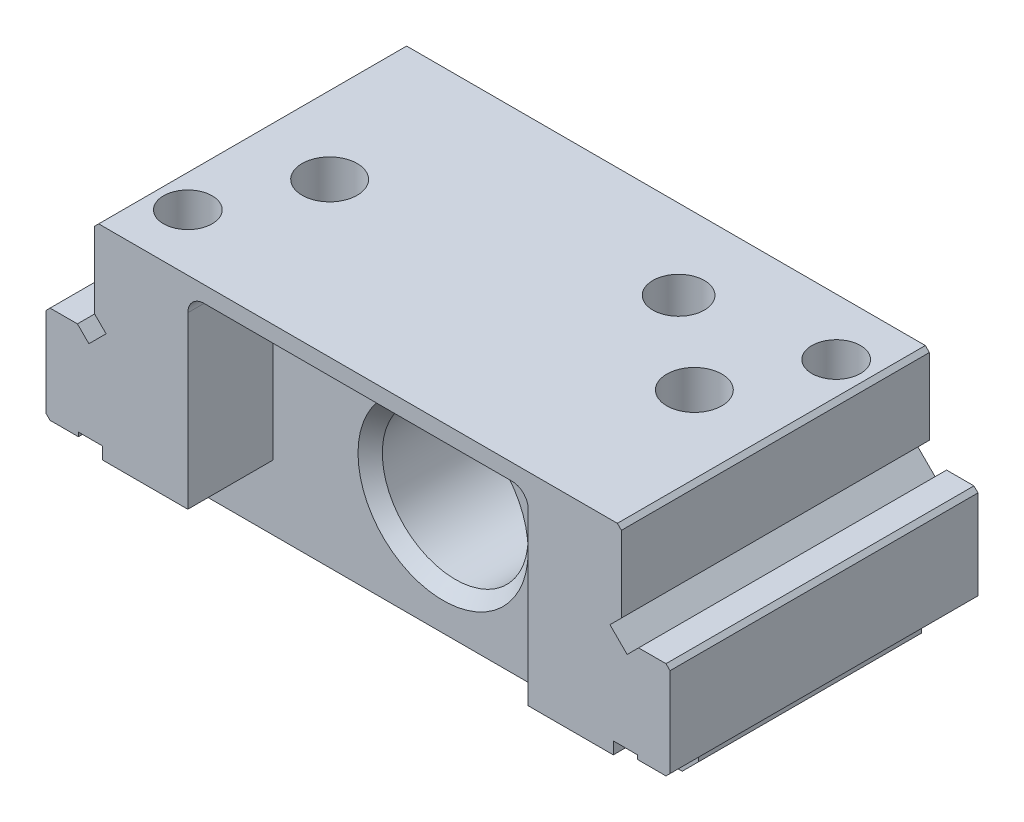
ISO-10303-21;
HEADER;
FILE_DESCRIPTION(('STEP AP214'),'2;1');
FILE_NAME('part.step','',(''),(''),'','','');
FILE_SCHEMA(('AUTOMOTIVE_DESIGN { 1 0 10303 214 1 1 1 1 }'));
ENDSEC;
DATA;
#1=APPLICATION_CONTEXT('core data for automotive mechanical design processes');
#2=APPLICATION_PROTOCOL_DEFINITION('international standard','automotive_design',2000,#1);
#3=PRODUCT_CONTEXT('',#1,'mechanical');
#4=PRODUCT('Part','Part','',(#3));
#5=PRODUCT_RELATED_PRODUCT_CATEGORY('part','',(#4));
#6=PRODUCT_DEFINITION_FORMATION('','',#4);
#7=PRODUCT_DEFINITION_CONTEXT('part definition',#1,'design');
#8=PRODUCT_DEFINITION('design','',#6,#7);
#9=PRODUCT_DEFINITION_SHAPE('','',#8);
#10=(LENGTH_UNIT() NAMED_UNIT(*) SI_UNIT(.MILLI.,.METRE.));
#11=(NAMED_UNIT(*) PLANE_ANGLE_UNIT() SI_UNIT($,.RADIAN.));
#12=(NAMED_UNIT(*) SI_UNIT($,.STERADIAN.) SOLID_ANGLE_UNIT());
#13=UNCERTAINTY_MEASURE_WITH_UNIT(LENGTH_MEASURE(1.E-05),#10,'distance_accuracy_value','');
#14=(GEOMETRIC_REPRESENTATION_CONTEXT(3) GLOBAL_UNCERTAINTY_ASSIGNED_CONTEXT((#13)) GLOBAL_UNIT_ASSIGNED_CONTEXT((#10,
#11,#12)) REPRESENTATION_CONTEXT('',''));
#15=CARTESIAN_POINT('',(0.,0.,0.));
#16=DIRECTION('',(0.,0.,1.));
#17=DIRECTION('',(1.,0.,0.));
#18=AXIS2_PLACEMENT_3D('',#15,#16,#17);
#19=CARTESIAN_POINT('',(0.,14.,27.5));
#20=DIRECTION('',(0.,0.,1.));
#21=DIRECTION('',(1.,0.,0.));
#22=AXIS2_PLACEMENT_3D('',#19,#20,#21);
#23=CONICAL_SURFACE('',#22,10.5,0.785398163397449);
#24=CARTESIAN_POINT('',(0.,14.,26.));
#25=DIRECTION('',(0.,0.,1.));
#26=DIRECTION('',(1.,0.,0.));
#27=AXIS2_PLACEMENT_3D('',#24,#25,#26);
#28=CIRCLE('',#27,9.);
#29=CARTESIAN_POINT('',(9.,14.,26.));
#30=VERTEX_POINT('',#29);
#31=EDGE_CURVE('E430',#30,#30,#28,.F.);
#32=ORIENTED_EDGE('',*,*,#31,.T.);
#33=EDGE_LOOP('',(#32));
#34=FACE_BOUND('',#33,.T.);
#35=CARTESIAN_POINT('',(0.,14.,27.5));
#36=DIRECTION('',(0.,0.,1.));
#37=DIRECTION('',(1.,0.,0.));
#38=AXIS2_PLACEMENT_3D('',#35,#36,#37);
#39=CIRCLE('',#38,10.5);
#40=CARTESIAN_POINT('',(10.5,14.,27.5));
#41=VERTEX_POINT('',#40);
#42=EDGE_CURVE('E19',#41,#41,#39,.F.);
#43=ORIENTED_EDGE('',*,*,#42,.F.);
#44=EDGE_LOOP('',(#43));
#45=FACE_BOUND('',#44,.T.);
#46=ADVANCED_FACE('F16',(#34,#45),#23,.F.);
#47=CARTESIAN_POINT('',(0.,0.,0.299999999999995));
#48=DIRECTION('',(0.,0.,1.));
#49=DIRECTION('',(1.,0.,0.));
#50=AXIS2_PLACEMENT_3D('',#47,#48,#49);
#51=PLANE('',#50);
#52=DIRECTION('',(0.,1.,0.));
#53=VECTOR('',#52,1.);
#54=CARTESIAN_POINT('',(17.4743589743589,13.025641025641,0.299999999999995));
#55=LINE('',#54,#53);
#56=CARTESIAN_POINT('',(17.4743589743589,13.025641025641,0.299999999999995));
#57=VERTEX_POINT('',#56);
#58=CARTESIAN_POINT('',(17.4743589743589,12.,0.299999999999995));
#59=VERTEX_POINT('',#58);
#60=EDGE_CURVE('E406',#57,#59,#55,.F.);
#61=ORIENTED_EDGE('',*,*,#60,.F.);
#62=DIRECTION('',(1.,0.,0.));
#63=VECTOR('',#62,1.);
#64=CARTESIAN_POINT('',(21.3205128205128,13.025641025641,0.299999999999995));
#65=LINE('',#64,#63);
#66=CARTESIAN_POINT('',(21.3205128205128,13.025641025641,0.299999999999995));
#67=VERTEX_POINT('',#66);
#68=EDGE_CURVE('E408',#67,#57,#65,.F.);
#69=ORIENTED_EDGE('',*,*,#68,.F.);
#70=DIRECTION('',(0.,1.,0.));
#71=VECTOR('',#70,1.);
#72=CARTESIAN_POINT('',(21.3205128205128,22.,0.299999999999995));
#73=LINE('',#72,#71);
#74=CARTESIAN_POINT('',(21.3205128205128,22.,0.299999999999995));
#75=VERTEX_POINT('',#74);
#76=EDGE_CURVE('E386',#75,#67,#73,.F.);
#77=ORIENTED_EDGE('',*,*,#76,.F.);
#78=DIRECTION('',(1.,0.,0.));
#79=VECTOR('',#78,1.);
#80=CARTESIAN_POINT('',(22.2179487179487,22.,0.299999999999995));
#81=LINE('',#80,#79);
#82=CARTESIAN_POINT('',(22.2179487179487,22.,0.299999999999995));
#83=VERTEX_POINT('',#82);
#84=EDGE_CURVE('E391',#83,#75,#81,.F.);
#85=ORIENTED_EDGE('',*,*,#84,.F.);
#86=DIRECTION('',(0.,-1.,0.));
#87=VECTOR('',#86,1.);
#88=CARTESIAN_POINT('',(22.2179487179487,12.,0.299999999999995));
#89=LINE('',#88,#87);
#90=CARTESIAN_POINT('',(22.2179487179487,12.,0.299999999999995));
#91=VERTEX_POINT('',#90);
#92=EDGE_CURVE('E396',#91,#83,#89,.F.);
#93=ORIENTED_EDGE('',*,*,#92,.F.);
#94=DIRECTION('',(-1.,0.,0.));
#95=VECTOR('',#94,1.);
#96=CARTESIAN_POINT('',(17.4743589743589,12.,0.299999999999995));
#97=LINE('',#96,#95);
#98=EDGE_CURVE('E401',#59,#91,#97,.F.);
#99=ORIENTED_EDGE('',*,*,#98,.F.);
#100=EDGE_LOOP('',(#61,#69,#77,#85,#93,#99));
#101=FACE_BOUND('',#100,.T.);
#102=ADVANCED_FACE('F771',(#101),#51,.F.);
#103=CARTESIAN_POINT('',(0.,14.,5.));
#104=DIRECTION('',(0.,0.,-1.));
#105=DIRECTION('',(-1.,0.,0.));
#106=AXIS2_PLACEMENT_3D('',#103,#104,#105);
#107=CONICAL_SURFACE('',#106,10.5,1.02974425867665);
#108=CARTESIAN_POINT('',(0.,14.,5.90129092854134));
#109=DIRECTION('',(0.,0.,1.));
#110=DIRECTION('',(1.,0.,0.));
#111=AXIS2_PLACEMENT_3D('',#108,#109,#110);
#112=CIRCLE('',#111,9.);
#113=CARTESIAN_POINT('',(9.,14.,5.90129092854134));
#114=VERTEX_POINT('',#113);
#115=EDGE_CURVE('E410',#114,#114,#112,.T.);
#116=ORIENTED_EDGE('',*,*,#115,.T.);
#117=EDGE_LOOP('',(#116));
#118=FACE_BOUND('',#117,.T.);
#119=CARTESIAN_POINT('',(0.,14.,5.));
#120=DIRECTION('',(0.,0.,-1.));
#121=DIRECTION('',(-1.,0.,0.));
#122=AXIS2_PLACEMENT_3D('',#119,#120,#121);
#123=CIRCLE('',#122,10.5);
#124=CARTESIAN_POINT('',(-10.5,14.,5.));
#125=VERTEX_POINT('',#124);
#126=EDGE_CURVE('E360',#125,#125,#123,.T.);
#127=ORIENTED_EDGE('',*,*,#126,.T.);
#128=EDGE_LOOP('',(#127));
#129=FACE_BOUND('',#128,.T.);
#130=ADVANCED_FACE('F777',(#118,#129),#107,.F.);
#131=CARTESIAN_POINT('',(0.,0.,27.5));
#132=DIRECTION('',(0.,0.,1.));
#133=DIRECTION('',(1.,0.,0.));
#134=AXIS2_PLACEMENT_3D('',#131,#132,#133);
#135=PLANE('',#134);
#136=ORIENTED_EDGE('',*,*,#42,.T.);
#137=EDGE_LOOP('',(#136));
#138=FACE_BOUND('',#137,.T.);
#139=DIRECTION('',(-0.707106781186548,-0.707106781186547,0.));
#140=VECTOR('',#139,1.);
#141=CARTESIAN_POINT('',(31.5000000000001,2.00000000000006,27.5));
#142=LINE('',#141,#140);
#143=CARTESIAN_POINT('',(29.5,0.,27.5));
#144=VERTEX_POINT('',#143);
#145=CARTESIAN_POINT('',(31.5000000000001,2.,27.5));
#146=VERTEX_POINT('',#145);
#147=EDGE_CURVE('E477',#144,#146,#142,.F.);
#148=ORIENTED_EDGE('',*,*,#147,.T.);
#149=DIRECTION('',(0.,-1.,0.));
#150=VECTOR('',#149,1.);
#151=CARTESIAN_POINT('',(31.5000000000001,9.50000000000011,27.5));
#152=LINE('',#151,#150);
#153=CARTESIAN_POINT('',(31.5000000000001,7.99999999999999,27.5));
#154=VERTEX_POINT('',#153);
#155=EDGE_CURVE('E472',#146,#154,#152,.F.);
#156=ORIENTED_EDGE('',*,*,#155,.T.);
#157=DIRECTION('',(1.,0.,0.));
#158=VECTOR('',#157,1.);
#159=CARTESIAN_POINT('',(0.,7.99999999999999,27.5));
#160=LINE('',#159,#158);
#161=CARTESIAN_POINT('',(21.,7.99999999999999,27.5));
#162=VERTEX_POINT('',#161);
#163=EDGE_CURVE('E355',#162,#154,#160,.T.);
#164=ORIENTED_EDGE('',*,*,#163,.F.);
#165=DIRECTION('',(0.,1.,0.));
#166=VECTOR('',#165,1.);
#167=CARTESIAN_POINT('',(21.,0.,27.5));
#168=LINE('',#167,#166);
#169=CARTESIAN_POINT('',(21.,29.,27.5));
#170=VERTEX_POINT('',#169);
#171=EDGE_CURVE('E309',#162,#170,#168,.T.);
#172=ORIENTED_EDGE('',*,*,#171,.T.);
#173=CARTESIAN_POINT('',(19.0000000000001,29.,27.5));
#174=DIRECTION('',(0.,0.,1.));
#175=DIRECTION('',(1.,0.,0.));
#176=AXIS2_PLACEMENT_3D('',#173,#174,#175);
#177=CIRCLE('',#176,2.);
#178=CARTESIAN_POINT('',(19.0000000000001,31.,27.5));
#179=VERTEX_POINT('',#178);
#180=EDGE_CURVE('E323',#170,#179,#177,.T.);
#181=ORIENTED_EDGE('',*,*,#180,.T.);
#182=DIRECTION('',(1.,0.,0.));
#183=VECTOR('',#182,1.);
#184=CARTESIAN_POINT('',(0.,31.,27.5));
#185=LINE('',#184,#183);
#186=CARTESIAN_POINT('',(-18.9999999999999,31.,27.5));
#187=VERTEX_POINT('',#186);
#188=EDGE_CURVE('E314',#187,#179,#185,.T.);
#189=ORIENTED_EDGE('',*,*,#188,.F.);
#190=CARTESIAN_POINT('',(-18.9999999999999,29.,27.5));
#191=DIRECTION('',(0.,0.,1.));
#192=DIRECTION('',(1.,0.,0.));
#193=AXIS2_PLACEMENT_3D('',#190,#191,#192);
#194=CIRCLE('',#193,2.);
#195=CARTESIAN_POINT('',(-21.,29.,27.5));
#196=VERTEX_POINT('',#195);
#197=EDGE_CURVE('E335',#187,#196,#194,.T.);
#198=ORIENTED_EDGE('',*,*,#197,.T.);
#199=DIRECTION('',(0.,1.,0.));
#200=VECTOR('',#199,1.);
#201=CARTESIAN_POINT('',(-21.,0.,27.5));
#202=LINE('',#201,#200);
#203=CARTESIAN_POINT('',(-21.,8.,27.5));
#204=VERTEX_POINT('',#203);
#205=EDGE_CURVE('E453',#204,#196,#202,.T.);
#206=ORIENTED_EDGE('',*,*,#205,.F.);
#207=DIRECTION('',(-1.,0.,0.));
#208=VECTOR('',#207,1.);
#209=CARTESIAN_POINT('',(0.,8.00000000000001,27.5));
#210=LINE('',#209,#208);
#211=CARTESIAN_POINT('',(-31.4999999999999,7.99999999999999,27.5));
#212=VERTEX_POINT('',#211);
#213=EDGE_CURVE('E458',#204,#212,#210,.T.);
#214=ORIENTED_EDGE('',*,*,#213,.T.);
#215=DIRECTION('',(0.,1.,0.));
#216=VECTOR('',#215,1.);
#217=CARTESIAN_POINT('',(-31.4999999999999,1.99999999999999,27.5));
#218=LINE('',#217,#216);
#219=CARTESIAN_POINT('',(-31.4999999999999,1.99999999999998,27.5));
#220=VERTEX_POINT('',#219);
#221=EDGE_CURVE('E364',#212,#220,#218,.F.);
#222=ORIENTED_EDGE('',*,*,#221,.T.);
#223=DIRECTION('',(-0.707106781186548,0.707106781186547,0.));
#224=VECTOR('',#223,1.);
#225=CARTESIAN_POINT('',(-29.5,0.,27.5));
#226=LINE('',#225,#224);
#227=CARTESIAN_POINT('',(-29.5,0.,27.5));
#228=VERTEX_POINT('',#227);
#229=EDGE_CURVE('E370',#220,#228,#226,.F.);
#230=ORIENTED_EDGE('',*,*,#229,.T.);
#231=DIRECTION('',(-1.,0.,0.));
#232=VECTOR('',#231,1.);
#233=CARTESIAN_POINT('',(29.5,0.,27.5));
#234=LINE('',#233,#232);
#235=EDGE_CURVE('E376',#228,#144,#234,.F.);
#236=ORIENTED_EDGE('',*,*,#235,.T.);
#237=EDGE_LOOP('',(#148,#156,#164,#172,#181,#189,#198,#206,#214,#222,#230,#236));
#238=FACE_BOUND('',#237,.T.);
#239=ADVANCED_FACE('F326',(#138,#238),#135,.T.);
#240=CARTESIAN_POINT('',(-34.4999999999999,8.99999999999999,38.));
#241=DIRECTION('',(-1.,0.,0.));
#242=DIRECTION('',(0.,-1.,0.));
#243=AXIS2_PLACEMENT_3D('',#240,#241,#242);
#244=PLANE('',#243);
#245=DIRECTION('',(0.,-1.,0.));
#246=VECTOR('',#245,1.);
#247=CARTESIAN_POINT('',(-34.4999999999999,8.99999999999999,38.));
#248=LINE('',#247,#246);
#249=CARTESIAN_POINT('',(-34.4999999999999,8.99999999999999,38.));
#250=VERTEX_POINT('',#249);
#251=CARTESIAN_POINT('',(-34.4999999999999,9.49999999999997,38.));
#252=VERTEX_POINT('',#251);
#253=EDGE_CURVE('E449',#250,#252,#248,.F.);
#254=ORIENTED_EDGE('',*,*,#253,.F.);
#255=DIRECTION('',(0.,0.,1.));
#256=VECTOR('',#255,1.);
#257=CARTESIAN_POINT('',(-34.4999999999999,8.99999999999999,38.));
#258=LINE('',#257,#256);
#259=CARTESIAN_POINT('',(-34.4999999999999,8.99999999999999,0.));
#260=VERTEX_POINT('',#259);
#261=EDGE_CURVE('E866',#250,#260,#258,.F.);
#262=ORIENTED_EDGE('',*,*,#261,.T.);
#263=DIRECTION('',(0.,-1.,0.));
#264=VECTOR('',#263,1.);
#265=CARTESIAN_POINT('',(-34.4999999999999,8.99999999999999,0.));
#266=LINE('',#265,#264);
#267=CARTESIAN_POINT('',(-34.4999999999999,9.49999999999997,0.));
#268=VERTEX_POINT('',#267);
#269=EDGE_CURVE('E451',#268,#260,#266,.T.);
#270=ORIENTED_EDGE('',*,*,#269,.F.);
#271=DIRECTION('',(0.,0.,1.));
#272=VECTOR('',#271,1.);
#273=CARTESIAN_POINT('',(-34.4999999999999,9.49999999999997,38.));
#274=LINE('',#273,#272);
#275=EDGE_CURVE('E872',#268,#252,#274,.T.);
#276=ORIENTED_EDGE('',*,*,#275,.T.);
#277=EDGE_LOOP('',(#254,#262,#270,#276));
#278=FACE_BOUND('',#277,.T.);
#279=ADVANCED_FACE('F776',(#278),#244,.F.);
#280=CARTESIAN_POINT('',(-37.9999999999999,8.99999999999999,38.));
#281=DIRECTION('',(0.707106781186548,0.707106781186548,0.));
#282=DIRECTION('',(-0.707106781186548,0.707106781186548,0.));
#283=AXIS2_PLACEMENT_3D('',#280,#281,#282);
#284=PLANE('',#283);
#285=DIRECTION('',(-0.707106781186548,0.707106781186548,0.));
#286=VECTOR('',#285,1.);
#287=CARTESIAN_POINT('',(-37.9999999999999,8.99999999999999,0.));
#288=LINE('',#287,#286);
#289=CARTESIAN_POINT('',(-37.9999999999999,8.99999999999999,0.));
#290=VERTEX_POINT('',#289);
#291=CARTESIAN_POINT('',(-38.4999999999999,9.50000000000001,0.));
#292=VERTEX_POINT('',#291);
#293=EDGE_CURVE('E445',#290,#292,#288,.T.);
#294=ORIENTED_EDGE('',*,*,#293,.F.);
#295=DIRECTION('',(0.,0.,1.));
#296=VECTOR('',#295,1.);
#297=CARTESIAN_POINT('',(-37.9999999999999,9.,38.));
#298=LINE('',#297,#296);
#299=CARTESIAN_POINT('',(-37.9999999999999,9.,38.));
#300=VERTEX_POINT('',#299);
#301=EDGE_CURVE('E863',#290,#300,#298,.T.);
#302=ORIENTED_EDGE('',*,*,#301,.T.);
#303=DIRECTION('',(-0.707106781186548,0.707106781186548,0.));
#304=VECTOR('',#303,1.);
#305=CARTESIAN_POINT('',(-37.9999999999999,8.99999999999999,38.));
#306=LINE('',#305,#304);
#307=CARTESIAN_POINT('',(-38.4999999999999,9.50000000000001,38.));
#308=VERTEX_POINT('',#307);
#309=EDGE_CURVE('E447',#308,#300,#306,.F.);
#310=ORIENTED_EDGE('',*,*,#309,.F.);
#311=DIRECTION('',(0.,0.,1.));
#312=VECTOR('',#311,1.);
#313=CARTESIAN_POINT('',(-38.4999999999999,9.50000000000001,38.));
#314=LINE('',#313,#312);
#315=EDGE_CURVE('E860',#308,#292,#314,.F.);
#316=ORIENTED_EDGE('',*,*,#315,.T.);
#317=EDGE_LOOP('',(#294,#302,#310,#316));
#318=FACE_BOUND('',#317,.T.);
#319=ADVANCED_FACE('F783',(#318),#284,.F.);
#320=CARTESIAN_POINT('',(-38.4999999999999,20.5,38.));
#321=DIRECTION('',(0.707106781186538,-0.707106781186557,0.));
#322=DIRECTION('',(0.707106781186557,0.707106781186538,0.));
#323=AXIS2_PLACEMENT_3D('',#320,#321,#322);
#324=PLANE('',#323);
#325=DIRECTION('',(0.707106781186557,0.707106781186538,0.));
#326=VECTOR('',#325,1.);
#327=CARTESIAN_POINT('',(-38.4999999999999,20.5,0.));
#328=LINE('',#327,#326);
#329=CARTESIAN_POINT('',(-38.4999999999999,20.5,0.));
#330=VERTEX_POINT('',#329);
#331=CARTESIAN_POINT('',(-37.9999999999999,21.,0.));
#332=VERTEX_POINT('',#331);
#333=EDGE_CURVE('E441',#330,#332,#328,.T.);
#334=ORIENTED_EDGE('',*,*,#333,.F.);
#335=DIRECTION('',(0.,0.,1.));
#336=VECTOR('',#335,1.);
#337=CARTESIAN_POINT('',(-38.4999999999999,20.5,38.));
#338=LINE('',#337,#336);
#339=CARTESIAN_POINT('',(-38.4999999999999,20.5,38.));
#340=VERTEX_POINT('',#339);
#341=EDGE_CURVE('E857',#330,#340,#338,.T.);
#342=ORIENTED_EDGE('',*,*,#341,.T.);
#343=DIRECTION('',(0.707106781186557,0.707106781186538,0.));
#344=VECTOR('',#343,1.);
#345=CARTESIAN_POINT('',(-38.4999999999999,20.5,38.));
#346=LINE('',#345,#344);
#347=CARTESIAN_POINT('',(-37.9999999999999,21.,38.));
#348=VERTEX_POINT('',#347);
#349=EDGE_CURVE('E443',#348,#340,#346,.F.);
#350=ORIENTED_EDGE('',*,*,#349,.F.);
#351=DIRECTION('',(0.,0.,1.));
#352=VECTOR('',#351,1.);
#353=CARTESIAN_POINT('',(-37.9999999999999,21.,38.));
#354=LINE('',#353,#352);
#355=EDGE_CURVE('E854',#348,#332,#354,.F.);
#356=ORIENTED_EDGE('',*,*,#355,.T.);
#357=EDGE_LOOP('',(#334,#342,#350,#356));
#358=FACE_BOUND('',#357,.T.);
#359=ADVANCED_FACE('F1080',(#358),#324,.F.);
#360=CARTESIAN_POINT('',(38.0000000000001,21.,38.));
#361=DIRECTION('',(-0.707106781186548,-0.707106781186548,0.));
#362=DIRECTION('',(0.707106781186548,-0.707106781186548,0.));
#363=AXIS2_PLACEMENT_3D('',#360,#361,#362);
#364=PLANE('',#363);
#365=DIRECTION('',(0.707106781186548,-0.707106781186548,0.));
#366=VECTOR('',#365,1.);
#367=CARTESIAN_POINT('',(38.0000000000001,21.,0.));
#368=LINE('',#367,#366);
#369=CARTESIAN_POINT('',(38.0000000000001,21.,0.));
#370=VERTEX_POINT('',#369);
#371=CARTESIAN_POINT('',(38.5000000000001,20.5,0.));
#372=VERTEX_POINT('',#371);
#373=EDGE_CURVE('E437',#370,#372,#368,.T.);
#374=ORIENTED_EDGE('',*,*,#373,.F.);
#375=DIRECTION('',(0.,0.,1.));
#376=VECTOR('',#375,1.);
#377=CARTESIAN_POINT('',(38.0000000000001,21.,38.));
#378=LINE('',#377,#376);
#379=CARTESIAN_POINT('',(38.0000000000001,21.,38.));
#380=VERTEX_POINT('',#379);
#381=EDGE_CURVE('E831',#370,#380,#378,.T.);
#382=ORIENTED_EDGE('',*,*,#381,.T.);
#383=DIRECTION('',(0.707106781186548,-0.707106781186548,0.));
#384=VECTOR('',#383,1.);
#385=CARTESIAN_POINT('',(38.0000000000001,21.,38.));
#386=LINE('',#385,#384);
#387=CARTESIAN_POINT('',(38.5000000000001,20.5,38.));
#388=VERTEX_POINT('',#387);
#389=EDGE_CURVE('E439',#388,#380,#386,.F.);
#390=ORIENTED_EDGE('',*,*,#389,.F.);
#391=DIRECTION('',(0.,0.,1.));
#392=VECTOR('',#391,1.);
#393=CARTESIAN_POINT('',(38.5000000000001,20.5,38.));
#394=LINE('',#393,#392);
#395=EDGE_CURVE('E828',#388,#372,#394,.F.);
#396=ORIENTED_EDGE('',*,*,#395,.T.);
#397=EDGE_LOOP('',(#374,#382,#390,#396));
#398=FACE_BOUND('',#397,.T.);
#399=ADVANCED_FACE('F1059',(#398),#364,.F.);
#400=CARTESIAN_POINT('',(38.5000000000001,9.50000000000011,38.));
#401=DIRECTION('',(-0.707106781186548,0.707106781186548,0.));
#402=DIRECTION('',(-0.707106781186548,-0.707106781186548,0.));
#403=AXIS2_PLACEMENT_3D('',#400,#401,#402);
#404=PLANE('',#403);
#405=DIRECTION('',(-0.707106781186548,-0.707106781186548,0.));
#406=VECTOR('',#405,1.);
#407=CARTESIAN_POINT('',(38.5000000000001,9.50000000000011,0.));
#408=LINE('',#407,#406);
#409=CARTESIAN_POINT('',(38.5000000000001,9.50000000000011,0.));
#410=VERTEX_POINT('',#409);
#411=CARTESIAN_POINT('',(38.0000000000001,9.00000000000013,0.));
#412=VERTEX_POINT('',#411);
#413=EDGE_CURVE('E433',#410,#412,#408,.T.);
#414=ORIENTED_EDGE('',*,*,#413,.F.);
#415=DIRECTION('',(0.,0.,1.));
#416=VECTOR('',#415,1.);
#417=CARTESIAN_POINT('',(38.5000000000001,9.50000000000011,38.));
#418=LINE('',#417,#416);
#419=CARTESIAN_POINT('',(38.5000000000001,9.50000000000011,38.));
#420=VERTEX_POINT('',#419);
#421=EDGE_CURVE('E825',#410,#420,#418,.T.);
#422=ORIENTED_EDGE('',*,*,#421,.T.);
#423=DIRECTION('',(-0.707106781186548,-0.707106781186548,0.));
#424=VECTOR('',#423,1.);
#425=CARTESIAN_POINT('',(38.5000000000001,9.50000000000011,38.));
#426=LINE('',#425,#424);
#427=CARTESIAN_POINT('',(38.0000000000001,9.00000000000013,38.));
#428=VERTEX_POINT('',#427);
#429=EDGE_CURVE('E435',#428,#420,#426,.F.);
#430=ORIENTED_EDGE('',*,*,#429,.F.);
#431=DIRECTION('',(0.,0.,1.));
#432=VECTOR('',#431,1.);
#433=CARTESIAN_POINT('',(38.0000000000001,9.00000000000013,38.));
#434=LINE('',#433,#432);
#435=EDGE_CURVE('E493',#428,#412,#434,.F.);
#436=ORIENTED_EDGE('',*,*,#435,.T.);
#437=EDGE_LOOP('',(#414,#422,#430,#436));
#438=FACE_BOUND('',#437,.T.);
#439=ADVANCED_FACE('F1051',(#438),#404,.F.);
#440=CARTESIAN_POINT('',(34.5000000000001,9.00000000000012,38.));
#441=DIRECTION('',(1.,0.,0.));
#442=DIRECTION('',(0.,1.,0.));
#443=AXIS2_PLACEMENT_3D('',#440,#441,#442);
#444=PLANE('',#443);
#445=DIRECTION('',(0.,1.,0.));
#446=VECTOR('',#445,1.);
#447=CARTESIAN_POINT('',(34.5000000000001,9.00000000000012,38.));
#448=LINE('',#447,#446);
#449=CARTESIAN_POINT('',(34.5000000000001,9.50000000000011,38.));
#450=VERTEX_POINT('',#449);
#451=CARTESIAN_POINT('',(34.5000000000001,9.00000000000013,38.));
#452=VERTEX_POINT('',#451);
#453=EDGE_CURVE('E428',#450,#452,#448,.F.);
#454=ORIENTED_EDGE('',*,*,#453,.F.);
#455=DIRECTION('',(0.,0.,1.));
#456=VECTOR('',#455,1.);
#457=CARTESIAN_POINT('',(34.5000000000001,9.50000000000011,38.));
#458=LINE('',#457,#456);
#459=CARTESIAN_POINT('',(34.5000000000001,9.50000000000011,0.));
#460=VERTEX_POINT('',#459);
#461=EDGE_CURVE('E492',#450,#460,#458,.F.);
#462=ORIENTED_EDGE('',*,*,#461,.T.);
#463=DIRECTION('',(0.,1.,0.));
#464=VECTOR('',#463,1.);
#465=CARTESIAN_POINT('',(34.5000000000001,9.00000000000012,0.));
#466=LINE('',#465,#464);
#467=CARTESIAN_POINT('',(34.5000000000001,9.00000000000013,0.));
#468=VERTEX_POINT('',#467);
#469=EDGE_CURVE('E431',#468,#460,#466,.T.);
#470=ORIENTED_EDGE('',*,*,#469,.F.);
#471=DIRECTION('',(0.,0.,1.));
#472=VECTOR('',#471,1.);
#473=CARTESIAN_POINT('',(34.5000000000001,9.00000000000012,38.));
#474=LINE('',#473,#472);
#475=EDGE_CURVE('E822',#468,#452,#474,.T.);
#476=ORIENTED_EDGE('',*,*,#475,.T.);
#477=EDGE_LOOP('',(#454,#462,#470,#476));
#478=FACE_BOUND('',#477,.T.);
#479=ADVANCED_FACE('F712',(#478),#444,.F.);
#480=CARTESIAN_POINT('',(0.,14.,0.));
#481=DIRECTION('',(0.,0.,1.));
#482=DIRECTION('',(1.,0.,0.));
#483=AXIS2_PLACEMENT_3D('',#480,#481,#482);
#484=CYLINDRICAL_SURFACE('',#483,9.);
#485=CARTESIAN_POINT('',(9.,14.,7.79249424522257));
#486=CARTESIAN_POINT('',(9.00000059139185,14.1340577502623,7.79249602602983));
#487=CARTESIAN_POINT('',(8.9970020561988,14.2681053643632,7.79598528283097));
#488=CARTESIAN_POINT('',(8.98504577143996,14.5356084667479,7.81008883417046));
#489=CARTESIAN_POINT('',(8.97608630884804,14.6690637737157,7.82070517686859));
#490=CARTESIAN_POINT('',(8.95232432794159,14.9347105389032,7.84949838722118));
#491=CARTESIAN_POINT('',(8.93751868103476,15.0669012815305,7.86767930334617));
#492=CARTESIAN_POINT('',(8.90230152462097,15.329098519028,7.91233505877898));
#493=CARTESIAN_POINT('',(8.88189217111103,15.4591058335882,7.93880670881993));
#494=CARTESIAN_POINT('',(8.84322206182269,15.6749089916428,7.99117997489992));
#495=CARTESIAN_POINT('',(8.82635510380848,15.7615703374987,8.01456616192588));
#496=CARTESIAN_POINT('',(8.79040686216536,15.9329794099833,8.06613391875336));
#497=CARTESIAN_POINT('',(8.77132605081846,16.0177275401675,8.09431446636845));
#498=CARTESIAN_POINT('',(8.73122861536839,16.1847217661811,8.15597645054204));
#499=CARTESIAN_POINT('',(8.71021391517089,16.2669702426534,8.18945264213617));
#500=CARTESIAN_POINT('',(8.66661157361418,16.4283397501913,8.26233307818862));
#501=CARTESIAN_POINT('',(8.64402443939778,16.5074617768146,8.30173541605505));
#502=CARTESIAN_POINT('',(8.58790295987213,16.6946364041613,8.40538548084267));
#503=CARTESIAN_POINT('',(8.55380180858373,16.8006654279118,8.47306920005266));
#504=CARTESIAN_POINT('',(8.48557962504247,17.0010136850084,8.62406070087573));
#505=CARTESIAN_POINT('',(8.45145871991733,17.0953520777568,8.70734234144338));
#506=CARTESIAN_POINT('',(8.39589946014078,17.2424062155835,8.86476630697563));
#507=CARTESIAN_POINT('',(8.37362935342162,17.2993013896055,8.9346850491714));
#508=CARTESIAN_POINT('',(8.3325041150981,17.4018257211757,9.08328611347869));
#509=CARTESIAN_POINT('',(8.31364442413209,17.4474699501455,9.16195650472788));
#510=CARTESIAN_POINT('',(8.28399981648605,17.5180343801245,9.31299472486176));
#511=CARTESIAN_POINT('',(8.27238748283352,17.5451577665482,9.38416347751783));
#512=CARTESIAN_POINT('',(8.25387627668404,17.5880467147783,9.53045122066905));
#513=CARTESIAN_POINT('',(8.24697457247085,17.6038191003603,9.60556780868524));
#514=CARTESIAN_POINT('',(8.23859256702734,17.6229420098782,9.75799110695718));
#515=CARTESIAN_POINT('',(8.23713360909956,17.6262436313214,9.83530524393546));
#516=CARTESIAN_POINT('',(8.23986510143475,17.6200322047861,9.98931192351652));
#517=CARTESIAN_POINT('',(8.24405573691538,17.6105187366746,10.0660044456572));
#518=CARTESIAN_POINT('',(8.2571978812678,17.5803526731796,10.2117718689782));
#519=CARTESIAN_POINT('',(8.26584336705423,17.560415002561,10.2810260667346));
#520=CARTESIAN_POINT('',(8.28693032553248,17.511054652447,10.4154188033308));
#521=CARTESIAN_POINT('',(8.29937314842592,17.4816285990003,10.4805558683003));
#522=CARTESIAN_POINT('',(8.33270245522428,17.4012673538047,10.6308936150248));
#523=CARTESIAN_POINT('',(8.35497584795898,17.3464362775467,10.7137041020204));
#524=CARTESIAN_POINT('',(8.40275207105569,17.2246028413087,10.8687434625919));
#525=CARTESIAN_POINT('',(8.42826147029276,17.1575756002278,10.9409501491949));
#526=CARTESIAN_POINT('',(8.49286016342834,16.9805735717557,11.1068790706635));
#527=CARTESIAN_POINT('',(8.53266402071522,16.865283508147,11.1946166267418));
#528=CARTESIAN_POINT('',(8.61058761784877,16.6218763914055,11.3509096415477));
#529=CARTESIAN_POINT('',(8.64870307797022,16.4937291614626,11.419418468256));
#530=CARTESIAN_POINT('',(8.71349518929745,16.2554599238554,11.5282551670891));
#531=CARTESIAN_POINT('',(8.74093771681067,16.1468347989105,11.5714782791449));
#532=CARTESIAN_POINT('',(8.7923259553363,15.9255926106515,11.6490031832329));
#533=CARTESIAN_POINT('',(8.81626943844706,15.8129730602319,11.6832993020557));
#534=CARTESIAN_POINT('',(8.86011856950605,15.5848655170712,11.7440736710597));
#535=CARTESIAN_POINT('',(8.88002305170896,15.4693767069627,11.7705496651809));
#536=CARTESIAN_POINT('',(8.91544511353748,15.2364157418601,11.8165309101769));
#537=CARTESIAN_POINT('',(8.9309640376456,15.1189442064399,11.8360382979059));
#538=CARTESIAN_POINT('',(8.96265445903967,14.8356995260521,11.8752357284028));
#539=CARTESIAN_POINT('',(8.9766405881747,14.6692595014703,11.8919256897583));
#540=CARTESIAN_POINT('',(8.99531106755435,14.3352073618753,11.9140594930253));
#541=CARTESIAN_POINT('',(8.9999992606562,14.1675957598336,11.9195079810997));
#542=CARTESIAN_POINT('',(9.00000059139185,13.8659422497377,11.9195039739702));
#543=CARTESIAN_POINT('',(8.9970020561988,13.7318946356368,11.916014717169));
#544=CARTESIAN_POINT('',(8.98504577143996,13.4643915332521,11.9019111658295));
#545=CARTESIAN_POINT('',(8.97608630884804,13.3309362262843,11.8912948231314));
#546=CARTESIAN_POINT('',(8.9523243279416,13.0652894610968,11.8625016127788));
#547=CARTESIAN_POINT('',(8.93751868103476,12.9330987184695,11.8443206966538));
#548=CARTESIAN_POINT('',(8.90230152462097,12.670901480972,11.799664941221));
#549=CARTESIAN_POINT('',(8.88189217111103,12.5408941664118,11.7731932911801));
#550=CARTESIAN_POINT('',(8.84322206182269,12.3250910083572,11.7208200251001));
#551=CARTESIAN_POINT('',(8.82635510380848,12.2384296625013,11.6974338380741));
#552=CARTESIAN_POINT('',(8.79040686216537,12.0670205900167,11.6458660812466));
#553=CARTESIAN_POINT('',(8.77132605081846,11.9822724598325,11.6176855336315));
#554=CARTESIAN_POINT('',(8.73122861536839,11.8152782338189,11.5560235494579));
#555=CARTESIAN_POINT('',(8.71021391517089,11.7330297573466,11.5225473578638));
#556=CARTESIAN_POINT('',(8.66661157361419,11.5716602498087,11.4496669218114));
#557=CARTESIAN_POINT('',(8.64402443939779,11.4925382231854,11.4102645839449));
#558=CARTESIAN_POINT('',(8.58790295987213,11.3053635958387,11.3066145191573));
#559=CARTESIAN_POINT('',(8.55380180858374,11.1993345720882,11.2389307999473));
#560=CARTESIAN_POINT('',(8.48557962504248,10.9989863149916,11.0879392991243));
#561=CARTESIAN_POINT('',(8.45145871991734,10.9046479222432,11.0046576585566));
#562=CARTESIAN_POINT('',(8.39589946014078,10.7575937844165,10.8472336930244));
#563=CARTESIAN_POINT('',(8.37362935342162,10.7006986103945,10.7773149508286));
#564=CARTESIAN_POINT('',(8.3325041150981,10.5981742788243,10.6287138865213));
#565=CARTESIAN_POINT('',(8.31364442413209,10.5525300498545,10.5500434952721));
#566=CARTESIAN_POINT('',(8.28399981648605,10.4819656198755,10.3990052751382));
#567=CARTESIAN_POINT('',(8.27238748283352,10.4548422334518,10.3278365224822));
#568=CARTESIAN_POINT('',(8.25387627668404,10.4119532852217,10.1815487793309));
#569=CARTESIAN_POINT('',(8.24697457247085,10.3961808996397,10.1064321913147));
#570=CARTESIAN_POINT('',(8.23859256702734,10.3770579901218,9.95400889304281));
#571=CARTESIAN_POINT('',(8.23713360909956,10.3737563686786,9.87669475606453));
#572=CARTESIAN_POINT('',(8.23986510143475,10.3799677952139,9.72268807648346));
#573=CARTESIAN_POINT('',(8.24405573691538,10.3894812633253,9.64599555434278));
#574=CARTESIAN_POINT('',(8.2571978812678,10.4196473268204,9.50022813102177));
#575=CARTESIAN_POINT('',(8.26584336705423,10.439584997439,9.43097393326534));
#576=CARTESIAN_POINT('',(8.28693032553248,10.488945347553,9.29658119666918));
#577=CARTESIAN_POINT('',(8.29937314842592,10.5183714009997,9.23144413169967));
#578=CARTESIAN_POINT('',(8.33270245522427,10.5987326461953,9.08110638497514));
#579=CARTESIAN_POINT('',(8.35497584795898,10.6535637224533,8.99829589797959));
#580=CARTESIAN_POINT('',(8.40275207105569,10.7753971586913,8.84325653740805));
#581=CARTESIAN_POINT('',(8.42826147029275,10.8424243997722,8.77104985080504));
#582=CARTESIAN_POINT('',(8.49286016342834,11.0194264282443,8.60512092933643));
#583=CARTESIAN_POINT('',(8.53266402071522,11.134716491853,8.51738337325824));
#584=CARTESIAN_POINT('',(8.61058761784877,11.3781236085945,8.36109035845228));
#585=CARTESIAN_POINT('',(8.64870307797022,11.5062708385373,8.29258153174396));
#586=CARTESIAN_POINT('',(8.71349518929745,11.7445400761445,8.18374483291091));
#587=CARTESIAN_POINT('',(8.74093771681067,11.8531652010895,8.14052172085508));
#588=CARTESIAN_POINT('',(8.7923259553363,12.0744073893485,8.06299681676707));
#589=CARTESIAN_POINT('',(8.81626943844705,12.1870269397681,8.02870069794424));
#590=CARTESIAN_POINT('',(8.86011856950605,12.4151344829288,7.96792632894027));
#591=CARTESIAN_POINT('',(8.88002305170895,12.5306232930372,7.94145033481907));
#592=CARTESIAN_POINT('',(8.91544511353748,12.7635842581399,7.89546908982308));
#593=CARTESIAN_POINT('',(8.93096403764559,12.8810557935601,7.87596170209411));
#594=CARTESIAN_POINT('',(8.96265445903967,13.1643004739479,7.83676427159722));
#595=CARTESIAN_POINT('',(8.9766405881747,13.3307404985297,7.82007431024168));
#596=CARTESIAN_POINT('',(8.99531106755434,13.6647926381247,7.79794050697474));
#597=CARTESIAN_POINT('',(8.9999992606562,13.8324042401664,7.79249201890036));
#598=CARTESIAN_POINT('',(9.,14.,7.79249424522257));
#599=B_SPLINE_CURVE_WITH_KNOTS('',3,(#485,#486,#487,#488,#489,#490,#491,#492,#493,#494,#495,
#496,#497,#498,#499,#500,#501,#502,#503,#504,#505,#506,#507,#508,#509,#510,#511,#512,#513,#514,
#515,#516,#517,#518,#519,#520,#521,#522,#523,#524,#525,#526,#527,#528,#529,#530,#531,#532,#533,
#534,#535,#536,#537,#538,#539,#540,#541,#542,#543,#544,#545,#546,#547,#548,#549,#550,#551,#552,
#553,#554,#555,#556,#557,#558,#559,#560,#561,#562,#563,#564,#565,#566,#567,#568,#569,#570,#571,
#572,#573,#574,#575,#576,#577,#578,#579,#580,#581,#582,#583,#584,#585,#586,#587,#588,#589,#590,
#591,#592,#593,#594,#595,#596,#597,#598),.UNSPECIFIED.,.T.,.F.,(4,2,2,2,2,2,2,2,2,2,2,2,2,2,2,2,
2,2,2,2,2,2,2,2,2,2,2,2,2,2,2,2,2,2,2,2,2,2,2,2,2,2,2,2,2,2,2,2,2,2,2,2,2,2,2,2,4),(0.,
0.402076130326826,0.804267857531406,1.20667511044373,1.60892775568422,1.88277585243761,
2.15656563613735,2.43008592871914,2.70351841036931,3.09335671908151,3.48254743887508,
3.76017398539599,4.03742658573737,4.26758779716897,4.49761052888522,4.72853433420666,
4.95946571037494,5.17630955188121,5.39323058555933,5.6968774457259,6.00115085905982,
6.449389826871,6.8987066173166,7.25848492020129,7.61849131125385,7.97860146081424,
8.3386010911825,8.84147483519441,9.34414069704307,9.7462168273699,10.1484085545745,
10.5508158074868,10.9530684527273,11.2269165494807,11.5007063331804,11.7742266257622,
12.0476591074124,12.4374974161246,12.8266881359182,13.1043146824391,13.3815672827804,
13.6117284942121,13.8417512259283,14.0726750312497,14.303606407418,14.5204502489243,
14.7373712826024,15.041018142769,15.3452915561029,15.7935305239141,16.2428473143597,
16.6026256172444,16.9626320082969,17.3227421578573,17.6827417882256,18.1856155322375,
18.6882813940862),.UNSPECIFIED.);
#600=CARTESIAN_POINT('',(9.,14.,7.79249424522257));
#601=VERTEX_POINT('',#600);
#602=EDGE_CURVE('E427',#601,#601,#599,.T.);
#603=ORIENTED_EDGE('',*,*,#602,.T.);
#604=EDGE_LOOP('',(#603));
#605=FACE_BOUND('',#604,.T.);
#606=ORIENTED_EDGE('',*,*,#115,.F.);
#607=EDGE_LOOP('',(#606));
#608=FACE_BOUND('',#607,.T.);
#609=ORIENTED_EDGE('',*,*,#31,.F.);
#610=EDGE_LOOP('',(#609));
#611=FACE_BOUND('',#610,.T.);
#612=ADVANCED_FACE('F542',(#605,#608,#611),#484,.F.);
#613=CARTESIAN_POINT('',(11.4130000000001,7.59999999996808,9.85599999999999));
#614=DIRECTION('',(0.,1.,0.));
#615=DIRECTION('',(-1.,0.,0.));
#616=AXIS2_PLACEMENT_3D('',#613,#614,#615);
#617=CONICAL_SURFACE('',#616,3.17499999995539,1.02974425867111);
#618=CARTESIAN_POINT('',(11.4130000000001,5.69226753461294,9.85599999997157));
#619=VERTEX_POINT('',#618);
#620=VERTEX_LOOP('',#619);
#621=FACE_BOUND('',#620,.T.);
#622=CARTESIAN_POINT('',(11.4130000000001,7.59999999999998,9.85599999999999));
#623=DIRECTION('',(0.,1.,0.));
#624=DIRECTION('',(-1.,0.,0.));
#625=AXIS2_PLACEMENT_3D('',#622,#623,#624);
#626=CIRCLE('',#625,3.17499999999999);
#627=CARTESIAN_POINT('',(8.23800000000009,7.59999999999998,9.85599999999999));
#628=VERTEX_POINT('',#627);
#629=EDGE_CURVE('E424',#628,#628,#626,.T.);
#630=ORIENTED_EDGE('',*,*,#629,.T.);
#631=EDGE_LOOP('',(#630));
#632=FACE_BOUND('',#631,.T.);
#633=ADVANCED_FACE('F704',(#621,#632),#617,.F.);
#634=CARTESIAN_POINT('',(-28.,24.0000000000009,31.));
#635=DIRECTION('',(0.,1.,0.));
#636=DIRECTION('',(-1.,0.,0.));
#637=AXIS2_PLACEMENT_3D('',#634,#635,#636);
#638=CONICAL_SURFACE('',#637,3.00000000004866,1.02974425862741);
#639=CARTESIAN_POINT('',(-28.,22.1974181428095,31.0000000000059));
#640=VERTEX_POINT('',#639);
#641=VERTEX_LOOP('',#640);
#642=FACE_BOUND('',#641,.T.);
#643=CARTESIAN_POINT('',(-27.9999999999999,24.,31.));
#644=DIRECTION('',(0.,1.,0.));
#645=DIRECTION('',(-1.,0.,0.));
#646=AXIS2_PLACEMENT_3D('',#643,#644,#645);
#647=CIRCLE('',#646,2.99999999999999);
#648=CARTESIAN_POINT('',(-30.9999999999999,24.,31.));
#649=VERTEX_POINT('',#648);
#650=EDGE_CURVE('E421',#649,#649,#647,.T.);
#651=ORIENTED_EDGE('',*,*,#650,.T.);
#652=EDGE_LOOP('',(#651));
#653=FACE_BOUND('',#652,.T.);
#654=ADVANCED_FACE('F701',(#642,#653),#638,.F.);
#655=CARTESIAN_POINT('',(27.9999999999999,24.0000000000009,7.00000000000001));
#656=DIRECTION('',(0.,1.,0.));
#657=DIRECTION('',(-1.,0.,0.));
#658=AXIS2_PLACEMENT_3D('',#655,#656,#657);
#659=CONICAL_SURFACE('',#658,2.99999999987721,1.02974425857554);
#660=CARTESIAN_POINT('',(27.9999999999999,22.1974181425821,7.00000000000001));
#661=VERTEX_POINT('',#660);
#662=VERTEX_LOOP('',#661);
#663=FACE_BOUND('',#662,.T.);
#664=CARTESIAN_POINT('',(28.,24.,7.00000000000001));
#665=DIRECTION('',(0.,1.,0.));
#666=DIRECTION('',(-1.,0.,0.));
#667=AXIS2_PLACEMENT_3D('',#664,#665,#666);
#668=CIRCLE('',#667,2.99999999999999);
#669=CARTESIAN_POINT('',(25.,24.,7.00000000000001));
#670=VERTEX_POINT('',#669);
#671=EDGE_CURVE('E418',#670,#670,#668,.T.);
#672=ORIENTED_EDGE('',*,*,#671,.T.);
#673=EDGE_LOOP('',(#672));
#674=FACE_BOUND('',#673,.T.);
#675=ADVANCED_FACE('F697',(#663,#674),#659,.F.);
#676=CARTESIAN_POINT('',(22.5,13.2388000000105,19.));
#677=DIRECTION('',(0.,1.,0.));
#678=DIRECTION('',(-1.,0.,0.));
#679=AXIS2_PLACEMENT_3D('',#676,#677,#678);
#680=CONICAL_SURFACE('',#679,3.40000000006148,1.02974425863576);
#681=CARTESIAN_POINT('',(22.5,11.1958738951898,19.));
#682=VERTEX_POINT('',#681);
#683=VERTEX_LOOP('',#682);
#684=FACE_BOUND('',#683,.T.);
#685=CARTESIAN_POINT('',(22.5000000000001,13.2388,19.));
#686=DIRECTION('',(0.,1.,0.));
#687=DIRECTION('',(-1.,0.,0.));
#688=AXIS2_PLACEMENT_3D('',#685,#686,#687);
#689=CIRCLE('',#688,3.4);
#690=CARTESIAN_POINT('',(19.1000000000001,13.2388,19.));
#691=VERTEX_POINT('',#690);
#692=EDGE_CURVE('E415',#691,#691,#689,.T.);
#693=ORIENTED_EDGE('',*,*,#692,.T.);
#694=EDGE_LOOP('',(#693));
#695=FACE_BOUND('',#694,.T.);
#696=ADVANCED_FACE('F693',(#684,#695),#680,.F.);
#697=CARTESIAN_POINT('',(-22.5,13.2388000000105,19.));
#698=DIRECTION('',(0.,1.,0.));
#699=DIRECTION('',(-1.,0.,0.));
#700=AXIS2_PLACEMENT_3D('',#697,#698,#699);
#701=CONICAL_SURFACE('',#700,3.40000000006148,1.02974425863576);
#702=CARTESIAN_POINT('',(-22.5,11.1958738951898,19.));
#703=VERTEX_POINT('',#702);
#704=VERTEX_LOOP('',#703);
#705=FACE_BOUND('',#704,.T.);
#706=CARTESIAN_POINT('',(-22.4999999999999,13.2388,19.));
#707=DIRECTION('',(0.,1.,0.));
#708=DIRECTION('',(-1.,0.,0.));
#709=AXIS2_PLACEMENT_3D('',#706,#707,#708);
#710=CIRCLE('',#709,3.4);
#711=CARTESIAN_POINT('',(-25.8999999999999,13.2388,19.));
#712=VERTEX_POINT('',#711);
#713=EDGE_CURVE('E411',#712,#712,#710,.T.);
#714=ORIENTED_EDGE('',*,*,#713,.T.);
#715=EDGE_LOOP('',(#714));
#716=FACE_BOUND('',#715,.T.);
#717=ADVANCED_FACE('F689',(#705,#716),#701,.F.);
#718=CARTESIAN_POINT('',(21.3205128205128,13.025641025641,0.299999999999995));
#719=DIRECTION('',(0.,-1.,0.));
#720=DIRECTION('',(1.,0.,0.));
#721=AXIS2_PLACEMENT_3D('',#718,#719,#720);
#722=PLANE('',#721);
#723=DIRECTION('',(-1.,0.,0.));
#724=VECTOR('',#723,1.);
#725=CARTESIAN_POINT('',(0.,13.025641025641,0.));
#726=LINE('',#725,#724);
#727=CARTESIAN_POINT('',(21.3205128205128,13.025641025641,0.));
#728=VERTEX_POINT('',#727);
#729=CARTESIAN_POINT('',(17.4743589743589,13.025641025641,0.));
#730=VERTEX_POINT('',#729);
#731=EDGE_CURVE('E414',#728,#730,#726,.T.);
#732=ORIENTED_EDGE('',*,*,#731,.F.);
#733=DIRECTION('',(0.,0.,1.));
#734=VECTOR('',#733,1.);
#735=CARTESIAN_POINT('',(21.3205128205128,13.025641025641,0.299999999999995));
#736=LINE('',#735,#734);
#737=EDGE_CURVE('E384',#67,#728,#736,.F.);
#738=ORIENTED_EDGE('',*,*,#737,.F.);
#739=ORIENTED_EDGE('',*,*,#68,.T.);
#740=DIRECTION('',(0.,0.,1.));
#741=VECTOR('',#740,1.);
#742=CARTESIAN_POINT('',(17.4743589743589,13.025641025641,0.299999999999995));
#743=LINE('',#742,#741);
#744=EDGE_CURVE('E403',#730,#57,#743,.T.);
#745=ORIENTED_EDGE('',*,*,#744,.F.);
#746=EDGE_LOOP('',(#732,#738,#739,#745));
#747=FACE_BOUND('',#746,.T.);
#748=ADVANCED_FACE('F685',(#747),#722,.T.);
#749=CARTESIAN_POINT('',(17.4743589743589,13.025641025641,0.299999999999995));
#750=DIRECTION('',(1.,0.,0.));
#751=DIRECTION('',(0.,1.,0.));
#752=AXIS2_PLACEMENT_3D('',#749,#750,#751);
#753=PLANE('',#752);
#754=DIRECTION('',(0.,1.,0.));
#755=VECTOR('',#754,1.);
#756=CARTESIAN_POINT('',(17.4743589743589,0.,0.));
#757=LINE('',#756,#755);
#758=CARTESIAN_POINT('',(17.4743589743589,12.,0.));
#759=VERTEX_POINT('',#758);
#760=EDGE_CURVE('E808',#730,#759,#757,.F.);
#761=ORIENTED_EDGE('',*,*,#760,.F.);
#762=ORIENTED_EDGE('',*,*,#744,.T.);
#763=ORIENTED_EDGE('',*,*,#60,.T.);
#764=DIRECTION('',(0.,0.,1.));
#765=VECTOR('',#764,1.);
#766=CARTESIAN_POINT('',(17.4743589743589,12.,0.299999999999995));
#767=LINE('',#766,#765);
#768=EDGE_CURVE('E398',#759,#59,#767,.T.);
#769=ORIENTED_EDGE('',*,*,#768,.F.);
#770=EDGE_LOOP('',(#761,#762,#763,#769));
#771=FACE_BOUND('',#770,.T.);
#772=ADVANCED_FACE('F681',(#771),#753,.T.);
#773=CARTESIAN_POINT('',(17.4743589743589,12.,0.299999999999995));
#774=DIRECTION('',(0.,1.,0.));
#775=DIRECTION('',(-1.,0.,0.));
#776=AXIS2_PLACEMENT_3D('',#773,#774,#775);
#777=PLANE('',#776);
#778=DIRECTION('',(-1.,0.,0.));
#779=VECTOR('',#778,1.);
#780=CARTESIAN_POINT('',(0.,12.,0.));
#781=LINE('',#780,#779);
#782=CARTESIAN_POINT('',(22.2179487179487,12.,0.));
#783=VERTEX_POINT('',#782);
#784=EDGE_CURVE('E804',#759,#783,#781,.F.);
#785=ORIENTED_EDGE('',*,*,#784,.F.);
#786=ORIENTED_EDGE('',*,*,#768,.T.);
#787=ORIENTED_EDGE('',*,*,#98,.T.);
#788=DIRECTION('',(0.,0.,1.));
#789=VECTOR('',#788,1.);
#790=CARTESIAN_POINT('',(22.2179487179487,12.,0.299999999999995));
#791=LINE('',#790,#789);
#792=EDGE_CURVE('E393',#783,#91,#791,.T.);
#793=ORIENTED_EDGE('',*,*,#792,.F.);
#794=EDGE_LOOP('',(#785,#786,#787,#793));
#795=FACE_BOUND('',#794,.T.);
#796=ADVANCED_FACE('F677',(#795),#777,.T.);
#797=CARTESIAN_POINT('',(22.2179487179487,12.,0.299999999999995));
#798=DIRECTION('',(-1.,0.,0.));
#799=DIRECTION('',(0.,-1.,0.));
#800=AXIS2_PLACEMENT_3D('',#797,#798,#799);
#801=PLANE('',#800);
#802=DIRECTION('',(0.,1.,0.));
#803=VECTOR('',#802,1.);
#804=CARTESIAN_POINT('',(22.2179487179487,0.,0.));
#805=LINE('',#804,#803);
#806=CARTESIAN_POINT('',(22.2179487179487,22.,0.));
#807=VERTEX_POINT('',#806);
#808=EDGE_CURVE('E807',#783,#807,#805,.T.);
#809=ORIENTED_EDGE('',*,*,#808,.F.);
#810=ORIENTED_EDGE('',*,*,#792,.T.);
#811=ORIENTED_EDGE('',*,*,#92,.T.);
#812=DIRECTION('',(0.,0.,1.));
#813=VECTOR('',#812,1.);
#814=CARTESIAN_POINT('',(22.2179487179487,22.,0.299999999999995));
#815=LINE('',#814,#813);
#816=EDGE_CURVE('E388',#807,#83,#815,.T.);
#817=ORIENTED_EDGE('',*,*,#816,.F.);
#818=EDGE_LOOP('',(#809,#810,#811,#817));
#819=FACE_BOUND('',#818,.T.);
#820=ADVANCED_FACE('F673',(#819),#801,.T.);
#821=CARTESIAN_POINT('',(22.2179487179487,22.,0.299999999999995));
#822=DIRECTION('',(0.,-1.,0.));
#823=DIRECTION('',(1.,0.,0.));
#824=AXIS2_PLACEMENT_3D('',#821,#822,#823);
#825=PLANE('',#824);
#826=DIRECTION('',(-1.,0.,0.));
#827=VECTOR('',#826,1.);
#828=CARTESIAN_POINT('',(0.,22.,0.));
#829=LINE('',#828,#827);
#830=CARTESIAN_POINT('',(21.3205128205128,22.,0.));
#831=VERTEX_POINT('',#830);
#832=EDGE_CURVE('E810',#807,#831,#829,.T.);
#833=ORIENTED_EDGE('',*,*,#832,.F.);
#834=ORIENTED_EDGE('',*,*,#816,.T.);
#835=ORIENTED_EDGE('',*,*,#84,.T.);
#836=DIRECTION('',(0.,0.,1.));
#837=VECTOR('',#836,1.);
#838=CARTESIAN_POINT('',(21.3205128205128,22.,0.299999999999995));
#839=LINE('',#838,#837);
#840=EDGE_CURVE('E380',#831,#75,#839,.T.);
#841=ORIENTED_EDGE('',*,*,#840,.F.);
#842=EDGE_LOOP('',(#833,#834,#835,#841));
#843=FACE_BOUND('',#842,.T.);
#844=ADVANCED_FACE('F669',(#843),#825,.T.);
#845=CARTESIAN_POINT('',(21.3205128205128,22.,0.299999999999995));
#846=DIRECTION('',(1.,0.,0.));
#847=DIRECTION('',(0.,1.,0.));
#848=AXIS2_PLACEMENT_3D('',#845,#846,#847);
#849=PLANE('',#848);
#850=DIRECTION('',(0.,1.,0.));
#851=VECTOR('',#850,1.);
#852=CARTESIAN_POINT('',(21.3205128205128,0.,0.));
#853=LINE('',#852,#851);
#854=EDGE_CURVE('E959',#831,#728,#853,.F.);
#855=ORIENTED_EDGE('',*,*,#854,.F.);
#856=ORIENTED_EDGE('',*,*,#840,.T.);
#857=ORIENTED_EDGE('',*,*,#76,.T.);
#858=ORIENTED_EDGE('',*,*,#737,.T.);
#859=EDGE_LOOP('',(#855,#856,#857,#858));
#860=FACE_BOUND('',#859,.T.);
#861=ADVANCED_FACE('F665',(#860),#849,.T.);
#862=CARTESIAN_POINT('',(31.5000000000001,9.50000000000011,38.));
#863=DIRECTION('',(-1.,0.,0.));
#864=DIRECTION('',(0.,-1.,0.));
#865=AXIS2_PLACEMENT_3D('',#862,#863,#864);
#866=PLANE('',#865);
#867=DIRECTION('',(0.,0.,1.));
#868=VECTOR('',#867,1.);
#869=CARTESIAN_POINT('',(31.5000000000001,2.00000000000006,38.));
#870=LINE('',#869,#868);
#871=CARTESIAN_POINT('',(31.5000000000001,2.00000000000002,0.));
#872=VERTEX_POINT('',#871);
#873=EDGE_CURVE('E379',#146,#872,#870,.F.);
#874=ORIENTED_EDGE('',*,*,#873,.T.);
#875=DIRECTION('',(0.,1.,0.));
#876=VECTOR('',#875,1.);
#877=CARTESIAN_POINT('',(31.5000000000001,0.,0.));
#878=LINE('',#877,#876);
#879=CARTESIAN_POINT('',(31.5000000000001,9.50000000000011,0.));
#880=VERTEX_POINT('',#879);
#881=EDGE_CURVE('E931',#880,#872,#878,.F.);
#882=ORIENTED_EDGE('',*,*,#881,.F.);
#883=DIRECTION('',(0.,0.,1.));
#884=VECTOR('',#883,1.);
#885=CARTESIAN_POINT('',(31.5000000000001,9.50000000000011,38.));
#886=LINE('',#885,#884);
#887=CARTESIAN_POINT('',(31.5000000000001,9.50000000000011,38.));
#888=VERTEX_POINT('',#887);
#889=EDGE_CURVE('E489',#880,#888,#886,.T.);
#890=ORIENTED_EDGE('',*,*,#889,.T.);
#891=DIRECTION('',(0.,-1.,0.));
#892=VECTOR('',#891,1.);
#893=CARTESIAN_POINT('',(31.5000000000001,9.50000000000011,38.));
#894=LINE('',#893,#892);
#895=CARTESIAN_POINT('',(31.5000000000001,8.00000000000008,38.));
#896=VERTEX_POINT('',#895);
#897=EDGE_CURVE('E383',#896,#888,#894,.F.);
#898=ORIENTED_EDGE('',*,*,#897,.F.);
#899=DIRECTION('',(0.,0.,1.));
#900=VECTOR('',#899,1.);
#901=CARTESIAN_POINT('',(31.5000000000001,7.99999999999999,27.5));
#902=LINE('',#901,#900);
#903=EDGE_CURVE('E343',#154,#896,#902,.T.);
#904=ORIENTED_EDGE('',*,*,#903,.F.);
#905=ORIENTED_EDGE('',*,*,#155,.F.);
#906=EDGE_LOOP('',(#874,#882,#890,#898,#904,#905));
#907=FACE_BOUND('',#906,.T.);
#908=ADVANCED_FACE('F661',(#907),#866,.F.);
#909=CARTESIAN_POINT('',(31.5000000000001,2.00000000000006,38.));
#910=DIRECTION('',(-0.707106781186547,0.707106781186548,0.));
#911=DIRECTION('',(-0.707106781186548,-0.707106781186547,0.));
#912=AXIS2_PLACEMENT_3D('',#909,#910,#911);
#913=PLANE('',#912);
#914=DIRECTION('',(-0.707106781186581,-0.707106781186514,0.));
#915=VECTOR('',#914,1.);
#916=CARTESIAN_POINT('',(31.5000000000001,2.,0.));
#917=LINE('',#916,#915);
#918=CARTESIAN_POINT('',(29.5,0.,0.));
#919=VERTEX_POINT('',#918);
#920=EDGE_CURVE('E929',#872,#919,#917,.T.);
#921=ORIENTED_EDGE('',*,*,#920,.F.);
#922=ORIENTED_EDGE('',*,*,#873,.F.);
#923=ORIENTED_EDGE('',*,*,#147,.F.);
#924=DIRECTION('',(0.,0.,1.));
#925=VECTOR('',#924,1.);
#926=CARTESIAN_POINT('',(29.5,0.,38.));
#927=LINE('',#926,#925);
#928=EDGE_CURVE('E373',#144,#919,#927,.F.);
#929=ORIENTED_EDGE('',*,*,#928,.T.);
#930=EDGE_LOOP('',(#921,#922,#923,#929));
#931=FACE_BOUND('',#930,.T.);
#932=ADVANCED_FACE('F657',(#931),#913,.F.);
#933=CARTESIAN_POINT('',(29.5,0.,38.));
#934=DIRECTION('',(0.,1.,0.));
#935=DIRECTION('',(-1.,0.,0.));
#936=AXIS2_PLACEMENT_3D('',#933,#934,#935);
#937=PLANE('',#936);
#938=DIRECTION('',(-1.,0.,0.));
#939=VECTOR('',#938,1.);
#940=CARTESIAN_POINT('',(0.,0.,0.));
#941=LINE('',#940,#939);
#942=CARTESIAN_POINT('',(-29.5000000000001,0.,0.));
#943=VERTEX_POINT('',#942);
#944=EDGE_CURVE('E927',#919,#943,#941,.T.);
#945=ORIENTED_EDGE('',*,*,#944,.F.);
#946=ORIENTED_EDGE('',*,*,#928,.F.);
#947=ORIENTED_EDGE('',*,*,#235,.F.);
#948=DIRECTION('',(0.,0.,1.));
#949=VECTOR('',#948,1.);
#950=CARTESIAN_POINT('',(-29.5,0.,38.));
#951=LINE('',#950,#949);
#952=EDGE_CURVE('E367',#228,#943,#951,.F.);
#953=ORIENTED_EDGE('',*,*,#952,.T.);
#954=EDGE_LOOP('',(#945,#946,#947,#953));
#955=FACE_BOUND('',#954,.T.);
#956=ADVANCED_FACE('F653',(#955),#937,.F.);
#957=CARTESIAN_POINT('',(-29.5,0.,38.));
#958=DIRECTION('',(0.707106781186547,0.707106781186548,0.));
#959=DIRECTION('',(-0.707106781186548,0.707106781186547,0.));
#960=AXIS2_PLACEMENT_3D('',#957,#958,#959);
#961=PLANE('',#960);
#962=DIRECTION('',(-0.707106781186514,0.707106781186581,0.));
#963=VECTOR('',#962,1.);
#964=CARTESIAN_POINT('',(-29.5000000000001,0.,0.));
#965=LINE('',#964,#963);
#966=CARTESIAN_POINT('',(-31.4999999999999,1.99999999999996,0.));
#967=VERTEX_POINT('',#966);
#968=EDGE_CURVE('E925',#943,#967,#965,.T.);
#969=ORIENTED_EDGE('',*,*,#968,.F.);
#970=ORIENTED_EDGE('',*,*,#952,.F.);
#971=ORIENTED_EDGE('',*,*,#229,.F.);
#972=DIRECTION('',(0.,0.,1.));
#973=VECTOR('',#972,1.);
#974=CARTESIAN_POINT('',(-31.4999999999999,1.99999999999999,38.));
#975=LINE('',#974,#973);
#976=EDGE_CURVE('E361',#220,#967,#975,.F.);
#977=ORIENTED_EDGE('',*,*,#976,.T.);
#978=EDGE_LOOP('',(#969,#970,#971,#977));
#979=FACE_BOUND('',#978,.T.);
#980=ADVANCED_FACE('F649',(#979),#961,.F.);
#981=CARTESIAN_POINT('',(-31.4999999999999,1.99999999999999,38.));
#982=DIRECTION('',(1.,0.,0.));
#983=DIRECTION('',(0.,1.,0.));
#984=AXIS2_PLACEMENT_3D('',#981,#982,#983);
#985=PLANE('',#984);
#986=DIRECTION('',(0.,1.,0.));
#987=VECTOR('',#986,1.);
#988=CARTESIAN_POINT('',(-31.4999999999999,1.99999999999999,38.));
#989=LINE('',#988,#987);
#990=CARTESIAN_POINT('',(-31.4999999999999,9.49999999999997,38.));
#991=VERTEX_POINT('',#990);
#992=CARTESIAN_POINT('',(-31.4999999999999,7.99999999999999,38.));
#993=VERTEX_POINT('',#992);
#994=EDGE_CURVE('E358',#991,#993,#989,.F.);
#995=ORIENTED_EDGE('',*,*,#994,.F.);
#996=DIRECTION('',(0.,0.,1.));
#997=VECTOR('',#996,1.);
#998=CARTESIAN_POINT('',(-31.4999999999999,9.49999999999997,38.));
#999=LINE('',#998,#997);
#1000=CARTESIAN_POINT('',(-31.4999999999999,9.49999999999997,0.));
#1001=VERTEX_POINT('',#1000);
#1002=EDGE_CURVE('E869',#991,#1001,#999,.F.);
#1003=ORIENTED_EDGE('',*,*,#1002,.T.);
#1004=DIRECTION('',(0.,1.,0.));
#1005=VECTOR('',#1004,1.);
#1006=CARTESIAN_POINT('',(-31.4999999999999,0.,0.));
#1007=LINE('',#1006,#1005);
#1008=EDGE_CURVE('E923',#967,#1001,#1007,.T.);
#1009=ORIENTED_EDGE('',*,*,#1008,.F.);
#1010=ORIENTED_EDGE('',*,*,#976,.F.);
#1011=ORIENTED_EDGE('',*,*,#221,.F.);
#1012=DIRECTION('',(0.,0.,1.));
#1013=VECTOR('',#1012,1.);
#1014=CARTESIAN_POINT('',(-31.4999999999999,8.,27.5));
#1015=LINE('',#1014,#1013);
#1016=EDGE_CURVE('E461',#212,#993,#1015,.T.);
#1017=ORIENTED_EDGE('',*,*,#1016,.T.);
#1018=EDGE_LOOP('',(#995,#1003,#1009,#1010,#1011,#1017));
#1019=FACE_BOUND('',#1018,.T.);
#1020=ADVANCED_FACE('F645',(#1019),#985,.F.);
#1021=CARTESIAN_POINT('',(0.,14.,0.));
#1022=DIRECTION('',(0.,0.,-1.));
#1023=DIRECTION('',(-1.,0.,0.));
#1024=AXIS2_PLACEMENT_3D('',#1021,#1022,#1023);
#1025=CYLINDRICAL_SURFACE('',#1024,10.5);
#1026=ORIENTED_EDGE('',*,*,#126,.F.);
#1027=EDGE_LOOP('',(#1026));
#1028=FACE_BOUND('',#1027,.T.);
#1029=CARTESIAN_POINT('',(0.,14.,0.));
#1030=DIRECTION('',(0.,0.,-1.));
#1031=DIRECTION('',(-1.,0.,0.));
#1032=AXIS2_PLACEMENT_3D('',#1029,#1030,#1031);
#1033=CIRCLE('',#1032,10.5);
#1034=CARTESIAN_POINT('',(-10.5,14.,0.));
#1035=VERTEX_POINT('',#1034);
#1036=EDGE_CURVE('E529',#1035,#1035,#1033,.F.);
#1037=ORIENTED_EDGE('',*,*,#1036,.F.);
#1038=EDGE_LOOP('',(#1037));
#1039=FACE_BOUND('',#1038,.T.);
#1040=ADVANCED_FACE('F641',(#1028,#1039),#1025,.F.);
#1041=CARTESIAN_POINT('',(0.,7.99999999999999,27.5));
#1042=DIRECTION('',(0.,-1.,0.));
#1043=DIRECTION('',(1.,0.,0.));
#1044=AXIS2_PLACEMENT_3D('',#1041,#1042,#1043);
#1045=PLANE('',#1044);
#1046=DIRECTION('',(-1.,0.,0.));
#1047=VECTOR('',#1046,1.);
#1048=CARTESIAN_POINT('',(0.,8.00000000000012,38.));
#1049=LINE('',#1048,#1047);
#1050=CARTESIAN_POINT('',(21.,8.00000000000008,38.));
#1051=VERTEX_POINT('',#1050);
#1052=EDGE_CURVE('E346',#896,#1051,#1049,.T.);
#1053=ORIENTED_EDGE('',*,*,#1052,.T.);
#1054=DIRECTION('',(0.,0.,1.));
#1055=VECTOR('',#1054,1.);
#1056=CARTESIAN_POINT('',(21.,7.99999999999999,27.5));
#1057=LINE('',#1056,#1055);
#1058=EDGE_CURVE('E340',#1051,#162,#1057,.F.);
#1059=ORIENTED_EDGE('',*,*,#1058,.T.);
#1060=ORIENTED_EDGE('',*,*,#163,.T.);
#1061=ORIENTED_EDGE('',*,*,#903,.T.);
#1062=EDGE_LOOP('',(#1053,#1059,#1060,#1061));
#1063=FACE_BOUND('',#1062,.T.);
#1064=ADVANCED_FACE('F637',(#1063),#1045,.T.);
#1065=CARTESIAN_POINT('',(21.,0.,27.5));
#1066=DIRECTION('',(1.,0.,0.));
#1067=DIRECTION('',(0.,1.,0.));
#1068=AXIS2_PLACEMENT_3D('',#1065,#1066,#1067);
#1069=PLANE('',#1068);
#1070=ORIENTED_EDGE('',*,*,#171,.F.);
#1071=ORIENTED_EDGE('',*,*,#1058,.F.);
#1072=DIRECTION('',(0.,1.,0.));
#1073=VECTOR('',#1072,1.);
#1074=CARTESIAN_POINT('',(21.,0.,38.));
#1075=LINE('',#1074,#1073);
#1076=CARTESIAN_POINT('',(21.,29.,38.));
#1077=VERTEX_POINT('',#1076);
#1078=EDGE_CURVE('E349',#1051,#1077,#1075,.T.);
#1079=ORIENTED_EDGE('',*,*,#1078,.T.);
#1080=DIRECTION('',(0.,0.,1.));
#1081=VECTOR('',#1080,1.);
#1082=CARTESIAN_POINT('',(21.0000000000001,29.,27.5));
#1083=LINE('',#1082,#1081);
#1084=EDGE_CURVE('E329',#1077,#170,#1083,.F.);
#1085=ORIENTED_EDGE('',*,*,#1084,.T.);
#1086=EDGE_LOOP('',(#1070,#1071,#1079,#1085));
#1087=FACE_BOUND('',#1086,.T.);
#1088=ADVANCED_FACE('F634',(#1087),#1069,.F.);
#1089=CARTESIAN_POINT('',(19.0000000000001,29.,27.5));
#1090=DIRECTION('',(0.,0.,1.));
#1091=DIRECTION('',(1.,0.,0.));
#1092=AXIS2_PLACEMENT_3D('',#1089,#1090,#1091);
#1093=CYLINDRICAL_SURFACE('',#1092,2.);
#1094=ORIENTED_EDGE('',*,*,#180,.F.);
#1095=ORIENTED_EDGE('',*,*,#1084,.F.);
#1096=CARTESIAN_POINT('',(19.0000000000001,29.,38.));
#1097=DIRECTION('',(0.,0.,1.));
#1098=DIRECTION('',(1.,0.,0.));
#1099=AXIS2_PLACEMENT_3D('',#1096,#1097,#1098);
#1100=CIRCLE('',#1099,2.);
#1101=CARTESIAN_POINT('',(19.0000000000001,31.,38.));
#1102=VERTEX_POINT('',#1101);
#1103=EDGE_CURVE('E333',#1077,#1102,#1100,.T.);
#1104=ORIENTED_EDGE('',*,*,#1103,.T.);
#1105=DIRECTION('',(0.,0.,1.));
#1106=VECTOR('',#1105,1.);
#1107=CARTESIAN_POINT('',(19.0000000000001,31.,27.5));
#1108=LINE('',#1107,#1106);
#1109=EDGE_CURVE('E318',#179,#1102,#1108,.T.);
#1110=ORIENTED_EDGE('',*,*,#1109,.F.);
#1111=EDGE_LOOP('',(#1094,#1095,#1104,#1110));
#1112=FACE_BOUND('',#1111,.T.);
#1113=ADVANCED_FACE('F331',(#1112),#1093,.F.);
#1114=CARTESIAN_POINT('',(0.,31.,27.5));
#1115=DIRECTION('',(0.,-1.,0.));
#1116=DIRECTION('',(1.,0.,0.));
#1117=AXIS2_PLACEMENT_3D('',#1114,#1115,#1116);
#1118=PLANE('',#1117);
#1119=DIRECTION('',(-1.,0.,0.));
#1120=VECTOR('',#1119,1.);
#1121=CARTESIAN_POINT('',(0.,31.,38.));
#1122=LINE('',#1121,#1120);
#1123=CARTESIAN_POINT('',(-18.9999999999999,31.,38.));
#1124=VERTEX_POINT('',#1123);
#1125=EDGE_CURVE('E527',#1102,#1124,#1122,.T.);
#1126=ORIENTED_EDGE('',*,*,#1125,.T.);
#1127=DIRECTION('',(0.,0.,1.));
#1128=VECTOR('',#1127,1.);
#1129=CARTESIAN_POINT('',(-18.9999999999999,31.,27.5));
#1130=LINE('',#1129,#1128);
#1131=EDGE_CURVE('E320',#1124,#187,#1130,.F.);
#1132=ORIENTED_EDGE('',*,*,#1131,.T.);
#1133=ORIENTED_EDGE('',*,*,#188,.T.);
#1134=ORIENTED_EDGE('',*,*,#1109,.T.);
#1135=EDGE_LOOP('',(#1126,#1132,#1133,#1134));
#1136=FACE_BOUND('',#1135,.T.);
#1137=ADVANCED_FACE('F316',(#1136),#1118,.T.);
#1138=CARTESIAN_POINT('',(-18.9999999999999,29.,27.5));
#1139=DIRECTION('',(0.,0.,1.));
#1140=DIRECTION('',(1.,0.,0.));
#1141=AXIS2_PLACEMENT_3D('',#1138,#1139,#1140);
#1142=CYLINDRICAL_SURFACE('',#1141,2.);
#1143=ORIENTED_EDGE('',*,*,#197,.F.);
#1144=ORIENTED_EDGE('',*,*,#1131,.F.);
#1145=CARTESIAN_POINT('',(-18.9999999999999,29.,38.));
#1146=DIRECTION('',(0.,0.,1.));
#1147=DIRECTION('',(1.,0.,0.));
#1148=AXIS2_PLACEMENT_3D('',#1145,#1146,#1147);
#1149=CIRCLE('',#1148,2.);
#1150=CARTESIAN_POINT('',(-21.,29.,38.));
#1151=VERTEX_POINT('',#1150);
#1152=EDGE_CURVE('E523',#1124,#1151,#1149,.T.);
#1153=ORIENTED_EDGE('',*,*,#1152,.T.);
#1154=DIRECTION('',(0.,0.,1.));
#1155=VECTOR('',#1154,1.);
#1156=CARTESIAN_POINT('',(-21.,29.,27.5));
#1157=LINE('',#1156,#1155);
#1158=EDGE_CURVE('E455',#196,#1151,#1157,.T.);
#1159=ORIENTED_EDGE('',*,*,#1158,.F.);
#1160=EDGE_LOOP('',(#1143,#1144,#1153,#1159));
#1161=FACE_BOUND('',#1160,.T.);
#1162=ADVANCED_FACE('F625',(#1161),#1142,.F.);
#1163=CARTESIAN_POINT('',(-21.,0.,27.5));
#1164=DIRECTION('',(1.,0.,0.));
#1165=DIRECTION('',(0.,1.,0.));
#1166=AXIS2_PLACEMENT_3D('',#1163,#1164,#1165);
#1167=PLANE('',#1166);
#1168=DIRECTION('',(0.,1.,0.));
#1169=VECTOR('',#1168,1.);
#1170=CARTESIAN_POINT('',(-20.9999999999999,0.,38.));
#1171=LINE('',#1170,#1169);
#1172=CARTESIAN_POINT('',(-21.,8.,38.));
#1173=VERTEX_POINT('',#1172);
#1174=EDGE_CURVE('E526',#1151,#1173,#1171,.F.);
#1175=ORIENTED_EDGE('',*,*,#1174,.T.);
#1176=DIRECTION('',(0.,0.,1.));
#1177=VECTOR('',#1176,1.);
#1178=CARTESIAN_POINT('',(-21.,8.,27.5));
#1179=LINE('',#1178,#1177);
#1180=EDGE_CURVE('E462',#1173,#204,#1179,.F.);
#1181=ORIENTED_EDGE('',*,*,#1180,.T.);
#1182=ORIENTED_EDGE('',*,*,#205,.T.);
#1183=ORIENTED_EDGE('',*,*,#1158,.T.);
#1184=EDGE_LOOP('',(#1175,#1181,#1182,#1183));
#1185=FACE_BOUND('',#1184,.T.);
#1186=ADVANCED_FACE('F621',(#1185),#1167,.T.);
#1187=CARTESIAN_POINT('',(0.,8.00000000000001,27.5));
#1188=DIRECTION('',(0.,1.,0.));
#1189=DIRECTION('',(-1.,0.,0.));
#1190=AXIS2_PLACEMENT_3D('',#1187,#1188,#1189);
#1191=PLANE('',#1190);
#1192=ORIENTED_EDGE('',*,*,#213,.F.);
#1193=ORIENTED_EDGE('',*,*,#1180,.F.);
#1194=DIRECTION('',(-1.,0.,0.));
#1195=VECTOR('',#1194,1.);
#1196=CARTESIAN_POINT('',(0.,7.99999999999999,38.));
#1197=LINE('',#1196,#1195);
#1198=EDGE_CURVE('E878',#1173,#993,#1197,.T.);
#1199=ORIENTED_EDGE('',*,*,#1198,.T.);
#1200=ORIENTED_EDGE('',*,*,#1016,.F.);
#1201=EDGE_LOOP('',(#1192,#1193,#1199,#1200));
#1202=FACE_BOUND('',#1201,.T.);
#1203=ADVANCED_FACE('F617',(#1202),#1191,.F.);
#1204=CARTESIAN_POINT('',(-34.4999999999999,9.49999999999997,38.));
#1205=DIRECTION('',(0.,1.,0.));
#1206=DIRECTION('',(-1.,0.,0.));
#1207=AXIS2_PLACEMENT_3D('',#1204,#1205,#1206);
#1208=PLANE('',#1207);
#1209=DIRECTION('',(-1.,0.,0.));
#1210=VECTOR('',#1209,1.);
#1211=CARTESIAN_POINT('',(0.,9.49999999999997,38.));
#1212=LINE('',#1211,#1210);
#1213=EDGE_CURVE('E881',#991,#252,#1212,.T.);
#1214=ORIENTED_EDGE('',*,*,#1213,.T.);
#1215=ORIENTED_EDGE('',*,*,#275,.F.);
#1216=DIRECTION('',(-1.,0.,0.));
#1217=VECTOR('',#1216,1.);
#1218=CARTESIAN_POINT('',(0.,9.49999999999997,0.));
#1219=LINE('',#1218,#1217);
#1220=EDGE_CURVE('E920',#1001,#268,#1219,.T.);
#1221=ORIENTED_EDGE('',*,*,#1220,.F.);
#1222=ORIENTED_EDGE('',*,*,#1002,.F.);
#1223=EDGE_LOOP('',(#1214,#1215,#1221,#1222));
#1224=FACE_BOUND('',#1223,.T.);
#1225=ADVANCED_FACE('F613',(#1224),#1208,.F.);
#1226=CARTESIAN_POINT('',(-34.4999999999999,8.99999999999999,38.));
#1227=DIRECTION('',(0.,1.,0.));
#1228=DIRECTION('',(-1.,0.,0.));
#1229=AXIS2_PLACEMENT_3D('',#1226,#1227,#1228);
#1230=PLANE('',#1229);
#1231=DIRECTION('',(-1.,0.,0.));
#1232=VECTOR('',#1231,1.);
#1233=CARTESIAN_POINT('',(0.,8.99999999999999,0.));
#1234=LINE('',#1233,#1232);
#1235=EDGE_CURVE('E917',#260,#290,#1234,.T.);
#1236=ORIENTED_EDGE('',*,*,#1235,.F.);
#1237=ORIENTED_EDGE('',*,*,#261,.F.);
#1238=DIRECTION('',(-1.,0.,0.));
#1239=VECTOR('',#1238,1.);
#1240=CARTESIAN_POINT('',(0.,8.99999999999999,38.));
#1241=LINE('',#1240,#1239);
#1242=EDGE_CURVE('E1026',#250,#300,#1241,.T.);
#1243=ORIENTED_EDGE('',*,*,#1242,.T.);
#1244=ORIENTED_EDGE('',*,*,#301,.F.);
#1245=EDGE_LOOP('',(#1236,#1237,#1243,#1244));
#1246=FACE_BOUND('',#1245,.T.);
#1247=ADVANCED_FACE('F609',(#1246),#1230,.F.);
#1248=CARTESIAN_POINT('',(-38.4999999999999,8.99999999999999,38.));
#1249=DIRECTION('',(1.,0.,0.));
#1250=DIRECTION('',(0.,1.,0.));
#1251=AXIS2_PLACEMENT_3D('',#1248,#1249,#1250);
#1252=PLANE('',#1251);
#1253=DIRECTION('',(0.,1.,0.));
#1254=VECTOR('',#1253,1.);
#1255=CARTESIAN_POINT('',(-38.4999999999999,0.,0.));
#1256=LINE('',#1255,#1254);
#1257=EDGE_CURVE('E914',#292,#330,#1256,.T.);
#1258=ORIENTED_EDGE('',*,*,#1257,.F.);
#1259=ORIENTED_EDGE('',*,*,#315,.F.);
#1260=DIRECTION('',(0.,1.,0.));
#1261=VECTOR('',#1260,1.);
#1262=CARTESIAN_POINT('',(-38.4999999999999,0.,38.));
#1263=LINE('',#1262,#1261);
#1264=EDGE_CURVE('E1023',#308,#340,#1263,.T.);
#1265=ORIENTED_EDGE('',*,*,#1264,.T.);
#1266=ORIENTED_EDGE('',*,*,#341,.F.);
#1267=EDGE_LOOP('',(#1258,#1259,#1265,#1266));
#1268=FACE_BOUND('',#1267,.T.);
#1269=ADVANCED_FACE('F605',(#1268),#1252,.F.);
#1270=CARTESIAN_POINT('',(-38.4999999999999,21.,38.));
#1271=DIRECTION('',(0.,-1.,0.));
#1272=DIRECTION('',(1.,0.,0.));
#1273=AXIS2_PLACEMENT_3D('',#1270,#1271,#1272);
#1274=PLANE('',#1273);
#1275=DIRECTION('',(-1.,0.,0.));
#1276=VECTOR('',#1275,1.);
#1277=CARTESIAN_POINT('',(0.,21.,38.));
#1278=LINE('',#1277,#1276);
#1279=CARTESIAN_POINT('',(-34.6213203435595,21.,38.));
#1280=VERTEX_POINT('',#1279);
#1281=EDGE_CURVE('E1020',#348,#1280,#1278,.F.);
#1282=ORIENTED_EDGE('',*,*,#1281,.T.);
#1283=DIRECTION('',(0.,0.,1.));
#1284=VECTOR('',#1283,1.);
#1285=CARTESIAN_POINT('',(-34.6213203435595,21.,38.));
#1286=LINE('',#1285,#1284);
#1287=CARTESIAN_POINT('',(-34.6213203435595,21.,0.));
#1288=VERTEX_POINT('',#1287);
#1289=EDGE_CURVE('E851',#1280,#1288,#1286,.F.);
#1290=ORIENTED_EDGE('',*,*,#1289,.T.);
#1291=DIRECTION('',(-1.,0.,0.));
#1292=VECTOR('',#1291,1.);
#1293=CARTESIAN_POINT('',(0.,21.,0.));
#1294=LINE('',#1293,#1292);
#1295=EDGE_CURVE('E912',#332,#1288,#1294,.F.);
#1296=ORIENTED_EDGE('',*,*,#1295,.F.);
#1297=ORIENTED_EDGE('',*,*,#355,.F.);
#1298=EDGE_LOOP('',(#1282,#1290,#1296,#1297));
#1299=FACE_BOUND('',#1298,.T.);
#1300=ADVANCED_FACE('F601',(#1299),#1274,.F.);
#1301=CARTESIAN_POINT('',(-33.2071067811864,19.5857864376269,38.));
#1302=DIRECTION('',(-0.707106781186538,-0.707106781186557,0.));
#1303=DIRECTION('',(0.707106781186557,-0.707106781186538,0.));
#1304=AXIS2_PLACEMENT_3D('',#1301,#1302,#1303);
#1305=PLANE('',#1304);
#1306=DIRECTION('',(0.707106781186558,-0.707106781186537,0.));
#1307=VECTOR('',#1306,1.);
#1308=CARTESIAN_POINT('',(-34.6213203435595,21.,38.));
#1309=LINE('',#1308,#1307);
#1310=CARTESIAN_POINT('',(-33.2071067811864,19.5857864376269,38.));
#1311=VERTEX_POINT('',#1310);
#1312=EDGE_CURVE('E1017',#1280,#1311,#1309,.T.);
#1313=ORIENTED_EDGE('',*,*,#1312,.T.);
#1314=DIRECTION('',(0.,0.,1.));
#1315=VECTOR('',#1314,1.);
#1316=CARTESIAN_POINT('',(-33.2071067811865,19.585786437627,38.));
#1317=LINE('',#1316,#1315);
#1318=CARTESIAN_POINT('',(-33.2071067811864,19.5857864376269,0.));
#1319=VERTEX_POINT('',#1318);
#1320=EDGE_CURVE('E849',#1311,#1319,#1317,.F.);
#1321=ORIENTED_EDGE('',*,*,#1320,.T.);
#1322=DIRECTION('',(0.707106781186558,-0.707106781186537,0.));
#1323=VECTOR('',#1322,1.);
#1324=CARTESIAN_POINT('',(-34.6213203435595,21.,0.));
#1325=LINE('',#1324,#1323);
#1326=EDGE_CURVE('E533',#1288,#1319,#1325,.T.);
#1327=ORIENTED_EDGE('',*,*,#1326,.F.);
#1328=ORIENTED_EDGE('',*,*,#1289,.F.);
#1329=EDGE_LOOP('',(#1313,#1321,#1327,#1328));
#1330=FACE_BOUND('',#1329,.T.);
#1331=ADVANCED_FACE('F597',(#1330),#1305,.F.);
#1332=CARTESIAN_POINT('',(-31.0857864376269,21.7071067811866,38.));
#1333=DIRECTION('',(0.707106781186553,-0.707106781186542,0.));
#1334=DIRECTION('',(0.707106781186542,0.707106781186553,0.));
#1335=AXIS2_PLACEMENT_3D('',#1332,#1333,#1334);
#1336=PLANE('',#1335);
#1337=DIRECTION('',(0.70710678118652,0.707106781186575,0.));
#1338=VECTOR('',#1337,1.);
#1339=CARTESIAN_POINT('',(-33.2071067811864,19.5857864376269,38.));
#1340=LINE('',#1339,#1338);
#1341=CARTESIAN_POINT('',(-31.0857864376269,21.7071067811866,38.));
#1342=VERTEX_POINT('',#1341);
#1343=EDGE_CURVE('E973',#1311,#1342,#1340,.T.);
#1344=ORIENTED_EDGE('',*,*,#1343,.T.);
#1345=DIRECTION('',(0.,0.,1.));
#1346=VECTOR('',#1345,1.);
#1347=CARTESIAN_POINT('',(-31.0857864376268,21.7071067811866,38.));
#1348=LINE('',#1347,#1346);
#1349=CARTESIAN_POINT('',(-31.0857864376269,21.7071067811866,0.));
#1350=VERTEX_POINT('',#1349);
#1351=EDGE_CURVE('E846',#1342,#1350,#1348,.F.);
#1352=ORIENTED_EDGE('',*,*,#1351,.T.);
#1353=DIRECTION('',(0.70710678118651,0.707106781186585,0.));
#1354=VECTOR('',#1353,1.);
#1355=CARTESIAN_POINT('',(-33.2071067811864,19.5857864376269,0.));
#1356=LINE('',#1355,#1354);
#1357=EDGE_CURVE('E957',#1319,#1350,#1356,.T.);
#1358=ORIENTED_EDGE('',*,*,#1357,.F.);
#1359=ORIENTED_EDGE('',*,*,#1320,.F.);
#1360=EDGE_LOOP('',(#1344,#1352,#1358,#1359));
#1361=FACE_BOUND('',#1360,.T.);
#1362=ADVANCED_FACE('F593',(#1361),#1336,.F.);
#1363=CARTESIAN_POINT('',(-32.4999999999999,23.1213203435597,38.));
#1364=DIRECTION('',(0.707106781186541,0.707106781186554,0.));
#1365=DIRECTION('',(-0.707106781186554,0.707106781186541,0.));
#1366=AXIS2_PLACEMENT_3D('',#1363,#1364,#1365);
#1367=PLANE('',#1366);
#1368=DIRECTION('',(-0.707106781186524,0.707106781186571,0.));
#1369=VECTOR('',#1368,1.);
#1370=CARTESIAN_POINT('',(-31.0857864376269,21.7071067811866,38.));
#1371=LINE('',#1370,#1369);
#1372=CARTESIAN_POINT('',(-32.4999999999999,23.1213203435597,38.));
#1373=VERTEX_POINT('',#1372);
#1374=EDGE_CURVE('E977',#1342,#1373,#1371,.T.);
#1375=ORIENTED_EDGE('',*,*,#1374,.T.);
#1376=DIRECTION('',(0.,0.,1.));
#1377=VECTOR('',#1376,1.);
#1378=CARTESIAN_POINT('',(-32.4999999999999,23.1213203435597,38.));
#1379=LINE('',#1378,#1377);
#1380=CARTESIAN_POINT('',(-32.4999999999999,23.1213203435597,0.));
#1381=VERTEX_POINT('',#1380);
#1382=EDGE_CURVE('E541',#1373,#1381,#1379,.F.);
#1383=ORIENTED_EDGE('',*,*,#1382,.T.);
#1384=DIRECTION('',(-0.707106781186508,0.707106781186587,0.));
#1385=VECTOR('',#1384,1.);
#1386=CARTESIAN_POINT('',(-31.085786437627,21.7071067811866,0.));
#1387=LINE('',#1386,#1385);
#1388=EDGE_CURVE('E955',#1350,#1381,#1387,.T.);
#1389=ORIENTED_EDGE('',*,*,#1388,.F.);
#1390=ORIENTED_EDGE('',*,*,#1351,.F.);
#1391=EDGE_LOOP('',(#1375,#1383,#1389,#1390));
#1392=FACE_BOUND('',#1391,.T.);
#1393=ADVANCED_FACE('F589',(#1392),#1367,.F.);
#1394=CARTESIAN_POINT('',(32.5000000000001,33.,38.));
#1395=DIRECTION('',(-1.,0.,0.));
#1396=DIRECTION('',(0.,-1.,0.));
#1397=AXIS2_PLACEMENT_3D('',#1394,#1395,#1396);
#1398=PLANE('',#1397);
#1399=DIRECTION('',(0.,1.,0.));
#1400=VECTOR('',#1399,1.);
#1401=CARTESIAN_POINT('',(32.5000000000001,0.,38.));
#1402=LINE('',#1401,#1400);
#1403=CARTESIAN_POINT('',(32.5000000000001,32.5,38.));
#1404=VERTEX_POINT('',#1403);
#1405=CARTESIAN_POINT('',(32.5000000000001,23.1213203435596,38.));
#1406=VERTEX_POINT('',#1405);
#1407=EDGE_CURVE('E1007',#1404,#1406,#1402,.F.);
#1408=ORIENTED_EDGE('',*,*,#1407,.T.);
#1409=DIRECTION('',(0.,0.,1.));
#1410=VECTOR('',#1409,1.);
#1411=CARTESIAN_POINT('',(32.5000000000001,23.1213203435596,38.));
#1412=LINE('',#1411,#1410);
#1413=CARTESIAN_POINT('',(32.5000000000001,23.1213203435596,0.));
#1414=VERTEX_POINT('',#1413);
#1415=EDGE_CURVE('E843',#1406,#1414,#1412,.F.);
#1416=ORIENTED_EDGE('',*,*,#1415,.T.);
#1417=DIRECTION('',(0.,1.,0.));
#1418=VECTOR('',#1417,1.);
#1419=CARTESIAN_POINT('',(32.5000000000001,0.,0.));
#1420=LINE('',#1419,#1418);
#1421=CARTESIAN_POINT('',(32.5000000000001,32.5,0.));
#1422=VERTEX_POINT('',#1421);
#1423=EDGE_CURVE('E951',#1422,#1414,#1420,.F.);
#1424=ORIENTED_EDGE('',*,*,#1423,.F.);
#1425=DIRECTION('',(0.,0.,1.));
#1426=VECTOR('',#1425,1.);
#1427=CARTESIAN_POINT('',(32.5000000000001,32.5,38.));
#1428=LINE('',#1427,#1426);
#1429=EDGE_CURVE('E350',#1422,#1404,#1428,.T.);
#1430=ORIENTED_EDGE('',*,*,#1429,.T.);
#1431=EDGE_LOOP('',(#1408,#1416,#1424,#1430));
#1432=FACE_BOUND('',#1431,.T.);
#1433=ADVANCED_FACE('F585',(#1432),#1398,.F.);
#1434=CARTESIAN_POINT('',(32.5000000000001,23.1213203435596,38.));
#1435=DIRECTION('',(-0.707106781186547,0.707106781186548,0.));
#1436=DIRECTION('',(-0.707106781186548,-0.707106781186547,0.));
#1437=AXIS2_PLACEMENT_3D('',#1434,#1435,#1436);
#1438=PLANE('',#1437);
#1439=DIRECTION('',(-0.707106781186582,-0.707106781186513,0.));
#1440=VECTOR('',#1439,1.);
#1441=CARTESIAN_POINT('',(32.5000000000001,23.1213203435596,38.));
#1442=LINE('',#1441,#1440);
#1443=CARTESIAN_POINT('',(31.0857864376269,21.7071067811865,38.));
#1444=VERTEX_POINT('',#1443);
#1445=EDGE_CURVE('E1004',#1406,#1444,#1442,.T.);
#1446=ORIENTED_EDGE('',*,*,#1445,.T.);
#1447=DIRECTION('',(0.,0.,1.));
#1448=VECTOR('',#1447,1.);
#1449=CARTESIAN_POINT('',(31.0857864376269,21.7071067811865,38.));
#1450=LINE('',#1449,#1448);
#1451=CARTESIAN_POINT('',(31.0857864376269,21.7071067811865,0.));
#1452=VERTEX_POINT('',#1451);
#1453=EDGE_CURVE('E840',#1444,#1452,#1450,.F.);
#1454=ORIENTED_EDGE('',*,*,#1453,.T.);
#1455=DIRECTION('',(-0.707106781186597,-0.707106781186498,0.));
#1456=VECTOR('',#1455,1.);
#1457=CARTESIAN_POINT('',(32.5000000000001,23.1213203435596,0.));
#1458=LINE('',#1457,#1456);
#1459=EDGE_CURVE('E949',#1414,#1452,#1458,.T.);
#1460=ORIENTED_EDGE('',*,*,#1459,.F.);
#1461=ORIENTED_EDGE('',*,*,#1415,.F.);
#1462=EDGE_LOOP('',(#1446,#1454,#1460,#1461));
#1463=FACE_BOUND('',#1462,.T.);
#1464=ADVANCED_FACE('F581',(#1463),#1438,.F.);
#1465=CARTESIAN_POINT('',(31.0857864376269,21.7071067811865,38.));
#1466=DIRECTION('',(-0.707106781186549,-0.707106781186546,0.));
#1467=DIRECTION('',(0.707106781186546,-0.707106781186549,0.));
#1468=AXIS2_PLACEMENT_3D('',#1465,#1466,#1467);
#1469=PLANE('',#1468);
#1470=DIRECTION('',(0.707106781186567,-0.707106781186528,0.));
#1471=VECTOR('',#1470,1.);
#1472=CARTESIAN_POINT('',(31.0857864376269,21.7071067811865,38.));
#1473=LINE('',#1472,#1471);
#1474=CARTESIAN_POINT('',(33.2071067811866,19.5857864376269,38.));
#1475=VERTEX_POINT('',#1474);
#1476=EDGE_CURVE('E1001',#1444,#1475,#1473,.T.);
#1477=ORIENTED_EDGE('',*,*,#1476,.T.);
#1478=DIRECTION('',(0.,0.,1.));
#1479=VECTOR('',#1478,1.);
#1480=CARTESIAN_POINT('',(33.2071067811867,19.5857864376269,38.));
#1481=LINE('',#1480,#1479);
#1482=CARTESIAN_POINT('',(33.2071067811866,19.5857864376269,0.));
#1483=VERTEX_POINT('',#1482);
#1484=EDGE_CURVE('E837',#1475,#1483,#1481,.F.);
#1485=ORIENTED_EDGE('',*,*,#1484,.T.);
#1486=DIRECTION('',(0.707106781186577,-0.707106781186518,0.));
#1487=VECTOR('',#1486,1.);
#1488=CARTESIAN_POINT('',(31.0857864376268,21.7071067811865,0.));
#1489=LINE('',#1488,#1487);
#1490=EDGE_CURVE('E947',#1452,#1483,#1489,.T.);
#1491=ORIENTED_EDGE('',*,*,#1490,.F.);
#1492=ORIENTED_EDGE('',*,*,#1453,.F.);
#1493=EDGE_LOOP('',(#1477,#1485,#1491,#1492));
#1494=FACE_BOUND('',#1493,.T.);
#1495=ADVANCED_FACE('F577',(#1494),#1469,.F.);
#1496=CARTESIAN_POINT('',(33.2071067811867,19.5857864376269,38.));
#1497=DIRECTION('',(0.707106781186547,-0.707106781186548,0.));
#1498=DIRECTION('',(0.707106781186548,0.707106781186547,0.));
#1499=AXIS2_PLACEMENT_3D('',#1496,#1497,#1498);
#1500=PLANE('',#1499);
#1501=DIRECTION('',(0.707106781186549,0.707106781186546,0.));
#1502=VECTOR('',#1501,1.);
#1503=CARTESIAN_POINT('',(33.2071067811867,19.5857864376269,38.));
#1504=LINE('',#1503,#1502);
#1505=CARTESIAN_POINT('',(34.6213203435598,21.,38.));
#1506=VERTEX_POINT('',#1505);
#1507=EDGE_CURVE('E998',#1475,#1506,#1504,.T.);
#1508=ORIENTED_EDGE('',*,*,#1507,.T.);
#1509=DIRECTION('',(0.,0.,1.));
#1510=VECTOR('',#1509,1.);
#1511=CARTESIAN_POINT('',(34.6213203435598,21.,38.));
#1512=LINE('',#1511,#1510);
#1513=CARTESIAN_POINT('',(34.6213203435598,21.,0.));
#1514=VERTEX_POINT('',#1513);
#1515=EDGE_CURVE('E834',#1506,#1514,#1512,.F.);
#1516=ORIENTED_EDGE('',*,*,#1515,.T.);
#1517=DIRECTION('',(0.707106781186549,0.707106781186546,0.));
#1518=VECTOR('',#1517,1.);
#1519=CARTESIAN_POINT('',(33.2071067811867,19.5857864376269,0.));
#1520=LINE('',#1519,#1518);
#1521=EDGE_CURVE('E945',#1483,#1514,#1520,.T.);
#1522=ORIENTED_EDGE('',*,*,#1521,.F.);
#1523=ORIENTED_EDGE('',*,*,#1484,.F.);
#1524=EDGE_LOOP('',(#1508,#1516,#1522,#1523));
#1525=FACE_BOUND('',#1524,.T.);
#1526=ADVANCED_FACE('F573',(#1525),#1500,.F.);
#1527=CARTESIAN_POINT('',(34.6213203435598,21.,38.));
#1528=DIRECTION('',(0.,-1.,0.));
#1529=DIRECTION('',(1.,0.,0.));
#1530=AXIS2_PLACEMENT_3D('',#1527,#1528,#1529);
#1531=PLANE('',#1530);
#1532=DIRECTION('',(-1.,0.,0.));
#1533=VECTOR('',#1532,1.);
#1534=CARTESIAN_POINT('',(0.,21.,0.));
#1535=LINE('',#1534,#1533);
#1536=EDGE_CURVE('E942',#1514,#370,#1535,.F.);
#1537=ORIENTED_EDGE('',*,*,#1536,.F.);
#1538=ORIENTED_EDGE('',*,*,#1515,.F.);
#1539=DIRECTION('',(-1.,0.,0.));
#1540=VECTOR('',#1539,1.);
#1541=CARTESIAN_POINT('',(0.,21.,38.));
#1542=LINE('',#1541,#1540);
#1543=EDGE_CURVE('E995',#1506,#380,#1542,.F.);
#1544=ORIENTED_EDGE('',*,*,#1543,.T.);
#1545=ORIENTED_EDGE('',*,*,#381,.F.);
#1546=EDGE_LOOP('',(#1537,#1538,#1544,#1545));
#1547=FACE_BOUND('',#1546,.T.);
#1548=ADVANCED_FACE('F569',(#1547),#1531,.F.);
#1549=CARTESIAN_POINT('',(38.5000000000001,21.,38.));
#1550=DIRECTION('',(-1.,0.,0.));
#1551=DIRECTION('',(0.,-1.,0.));
#1552=AXIS2_PLACEMENT_3D('',#1549,#1550,#1551);
#1553=PLANE('',#1552);
#1554=DIRECTION('',(0.,1.,0.));
#1555=VECTOR('',#1554,1.);
#1556=CARTESIAN_POINT('',(38.5000000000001,0.,0.));
#1557=LINE('',#1556,#1555);
#1558=EDGE_CURVE('E939',#372,#410,#1557,.F.);
#1559=ORIENTED_EDGE('',*,*,#1558,.F.);
#1560=ORIENTED_EDGE('',*,*,#395,.F.);
#1561=DIRECTION('',(0.,1.,0.));
#1562=VECTOR('',#1561,1.);
#1563=CARTESIAN_POINT('',(38.5000000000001,0.,38.));
#1564=LINE('',#1563,#1562);
#1565=EDGE_CURVE('E992',#388,#420,#1564,.F.);
#1566=ORIENTED_EDGE('',*,*,#1565,.T.);
#1567=ORIENTED_EDGE('',*,*,#421,.F.);
#1568=EDGE_LOOP('',(#1559,#1560,#1566,#1567));
#1569=FACE_BOUND('',#1568,.T.);
#1570=ADVANCED_FACE('F565',(#1569),#1553,.F.);
#1571=CARTESIAN_POINT('',(38.5000000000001,9.00000000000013,38.));
#1572=DIRECTION('',(0.,1.,0.));
#1573=DIRECTION('',(-1.,0.,0.));
#1574=AXIS2_PLACEMENT_3D('',#1571,#1572,#1573);
#1575=PLANE('',#1574);
#1576=DIRECTION('',(-1.,0.,0.));
#1577=VECTOR('',#1576,1.);
#1578=CARTESIAN_POINT('',(0.,9.00000000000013,38.));
#1579=LINE('',#1578,#1577);
#1580=EDGE_CURVE('E499',#428,#452,#1579,.T.);
#1581=ORIENTED_EDGE('',*,*,#1580,.T.);
#1582=ORIENTED_EDGE('',*,*,#475,.F.);
#1583=DIRECTION('',(-1.,0.,0.));
#1584=VECTOR('',#1583,1.);
#1585=CARTESIAN_POINT('',(0.,9.00000000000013,0.));
#1586=LINE('',#1585,#1584);
#1587=EDGE_CURVE('E936',#412,#468,#1586,.T.);
#1588=ORIENTED_EDGE('',*,*,#1587,.F.);
#1589=ORIENTED_EDGE('',*,*,#435,.F.);
#1590=EDGE_LOOP('',(#1581,#1582,#1588,#1589));
#1591=FACE_BOUND('',#1590,.T.);
#1592=ADVANCED_FACE('F561',(#1591),#1575,.F.);
#1593=CARTESIAN_POINT('',(34.5000000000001,9.50000000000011,38.));
#1594=DIRECTION('',(0.,1.,0.));
#1595=DIRECTION('',(-1.,0.,0.));
#1596=AXIS2_PLACEMENT_3D('',#1593,#1594,#1595);
#1597=PLANE('',#1596);
#1598=DIRECTION('',(-1.,0.,0.));
#1599=VECTOR('',#1598,1.);
#1600=CARTESIAN_POINT('',(0.,9.50000000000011,38.));
#1601=LINE('',#1600,#1599);
#1602=EDGE_CURVE('E496',#450,#888,#1601,.T.);
#1603=ORIENTED_EDGE('',*,*,#1602,.T.);
#1604=ORIENTED_EDGE('',*,*,#889,.F.);
#1605=DIRECTION('',(-1.,0.,0.));
#1606=VECTOR('',#1605,1.);
#1607=CARTESIAN_POINT('',(0.,9.50000000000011,0.));
#1608=LINE('',#1607,#1606);
#1609=EDGE_CURVE('E933',#460,#880,#1608,.T.);
#1610=ORIENTED_EDGE('',*,*,#1609,.F.);
#1611=ORIENTED_EDGE('',*,*,#461,.F.);
#1612=EDGE_LOOP('',(#1603,#1604,#1610,#1611));
#1613=FACE_BOUND('',#1612,.T.);
#1614=ADVANCED_FACE('F557',(#1613),#1597,.F.);
#1615=CARTESIAN_POINT('',(-32.4999999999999,23.1213203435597,38.));
#1616=DIRECTION('',(1.,0.,0.));
#1617=DIRECTION('',(0.,1.,0.));
#1618=AXIS2_PLACEMENT_3D('',#1615,#1616,#1617);
#1619=PLANE('',#1618);
#1620=DIRECTION('',(0.,1.,0.));
#1621=VECTOR('',#1620,1.);
#1622=CARTESIAN_POINT('',(-32.4999999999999,0.,0.));
#1623=LINE('',#1622,#1621);
#1624=CARTESIAN_POINT('',(-32.4999999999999,32.5,0.));
#1625=VERTEX_POINT('',#1624);
#1626=EDGE_CURVE('E953',#1381,#1625,#1623,.T.);
#1627=ORIENTED_EDGE('',*,*,#1626,.F.);
#1628=ORIENTED_EDGE('',*,*,#1382,.F.);
#1629=DIRECTION('',(0.,1.,0.));
#1630=VECTOR('',#1629,1.);
#1631=CARTESIAN_POINT('',(-32.4999999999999,0.,38.));
#1632=LINE('',#1631,#1630);
#1633=CARTESIAN_POINT('',(-32.4999999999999,32.5,38.));
#1634=VERTEX_POINT('',#1633);
#1635=EDGE_CURVE('E1013',#1373,#1634,#1632,.T.);
#1636=ORIENTED_EDGE('',*,*,#1635,.T.);
#1637=DIRECTION('',(0.,0.,1.));
#1638=VECTOR('',#1637,1.);
#1639=CARTESIAN_POINT('',(-32.4999999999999,32.5,38.));
#1640=LINE('',#1639,#1638);
#1641=EDGE_CURVE('E980',#1634,#1625,#1640,.F.);
#1642=ORIENTED_EDGE('',*,*,#1641,.T.);
#1643=EDGE_LOOP('',(#1627,#1628,#1636,#1642));
#1644=FACE_BOUND('',#1643,.T.);
#1645=ADVANCED_FACE('F552',(#1644),#1619,.F.);
#1646=CARTESIAN_POINT('',(11.4130000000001,33.,9.85599999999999));
#1647=DIRECTION('',(0.,1.,0.));
#1648=DIRECTION('',(-1.,0.,0.));
#1649=AXIS2_PLACEMENT_3D('',#1646,#1647,#1648);
#1650=CYLINDRICAL_SURFACE('',#1649,3.17499999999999);
#1651=ORIENTED_EDGE('',*,*,#629,.F.);
#1652=EDGE_LOOP('',(#1651));
#1653=FACE_BOUND('',#1652,.T.);
#1654=CARTESIAN_POINT('',(11.4130000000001,33.,9.85599999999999));
#1655=DIRECTION('',(0.,1.,0.));
#1656=DIRECTION('',(-1.,0.,0.));
#1657=AXIS2_PLACEMENT_3D('',#1654,#1655,#1656);
#1658=CIRCLE('',#1657,3.17499999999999);
#1659=CARTESIAN_POINT('',(8.23800000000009,33.,9.85599999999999));
#1660=VERTEX_POINT('',#1659);
#1661=EDGE_CURVE('E519',#1660,#1660,#1658,.T.);
#1662=ORIENTED_EDGE('',*,*,#1661,.T.);
#1663=EDGE_LOOP('',(#1662));
#1664=FACE_BOUND('',#1663,.T.);
#1665=ORIENTED_EDGE('',*,*,#602,.F.);
#1666=EDGE_LOOP('',(#1665));
#1667=FACE_BOUND('',#1666,.T.);
#1668=ADVANCED_FACE('F546',(#1653,#1664,#1667),#1650,.F.);
#1669=CARTESIAN_POINT('',(-27.9999999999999,33.,31.));
#1670=DIRECTION('',(0.,1.,0.));
#1671=DIRECTION('',(-1.,0.,0.));
#1672=AXIS2_PLACEMENT_3D('',#1669,#1670,#1671);
#1673=CYLINDRICAL_SURFACE('',#1672,2.99999999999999);
#1674=ORIENTED_EDGE('',*,*,#650,.F.);
#1675=EDGE_LOOP('',(#1674));
#1676=FACE_BOUND('',#1675,.T.);
#1677=CARTESIAN_POINT('',(-27.9999999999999,33.,31.));
#1678=DIRECTION('',(0.,1.,0.));
#1679=DIRECTION('',(-1.,0.,0.));
#1680=AXIS2_PLACEMENT_3D('',#1677,#1678,#1679);
#1681=CIRCLE('',#1680,2.99999999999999);
#1682=CARTESIAN_POINT('',(-30.9999999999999,33.,31.));
#1683=VERTEX_POINT('',#1682);
#1684=EDGE_CURVE('E516',#1683,#1683,#1681,.T.);
#1685=ORIENTED_EDGE('',*,*,#1684,.T.);
#1686=EDGE_LOOP('',(#1685));
#1687=FACE_BOUND('',#1686,.T.);
#1688=ADVANCED_FACE('F551',(#1676,#1687),#1673,.F.);
#1689=CARTESIAN_POINT('',(28.,33.,7.00000000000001));
#1690=DIRECTION('',(0.,1.,0.));
#1691=DIRECTION('',(-1.,0.,0.));
#1692=AXIS2_PLACEMENT_3D('',#1689,#1690,#1691);
#1693=CYLINDRICAL_SURFACE('',#1692,2.99999999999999);
#1694=ORIENTED_EDGE('',*,*,#671,.F.);
#1695=EDGE_LOOP('',(#1694));
#1696=FACE_BOUND('',#1695,.T.);
#1697=CARTESIAN_POINT('',(28.,33.,7.00000000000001));
#1698=DIRECTION('',(0.,1.,0.));
#1699=DIRECTION('',(-1.,0.,0.));
#1700=AXIS2_PLACEMENT_3D('',#1697,#1698,#1699);
#1701=CIRCLE('',#1700,2.99999999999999);
#1702=CARTESIAN_POINT('',(25.,33.,7.00000000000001));
#1703=VERTEX_POINT('',#1702);
#1704=EDGE_CURVE('E513',#1703,#1703,#1701,.T.);
#1705=ORIENTED_EDGE('',*,*,#1704,.T.);
#1706=EDGE_LOOP('',(#1705));
#1707=FACE_BOUND('',#1706,.T.);
#1708=ADVANCED_FACE('F745',(#1696,#1707),#1693,.F.);
#1709=CARTESIAN_POINT('',(22.5000000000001,33.,19.));
#1710=DIRECTION('',(0.,1.,0.));
#1711=DIRECTION('',(-1.,0.,0.));
#1712=AXIS2_PLACEMENT_3D('',#1709,#1710,#1711);
#1713=CYLINDRICAL_SURFACE('',#1712,3.4);
#1714=ORIENTED_EDGE('',*,*,#692,.F.);
#1715=EDGE_LOOP('',(#1714));
#1716=FACE_BOUND('',#1715,.T.);
#1717=CARTESIAN_POINT('',(22.5000000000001,33.,19.));
#1718=DIRECTION('',(0.,1.,0.));
#1719=DIRECTION('',(-1.,0.,0.));
#1720=AXIS2_PLACEMENT_3D('',#1717,#1718,#1719);
#1721=CIRCLE('',#1720,3.4);
#1722=CARTESIAN_POINT('',(19.1000000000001,33.,19.));
#1723=VERTEX_POINT('',#1722);
#1724=EDGE_CURVE('E510',#1723,#1723,#1721,.T.);
#1725=ORIENTED_EDGE('',*,*,#1724,.T.);
#1726=EDGE_LOOP('',(#1725));
#1727=FACE_BOUND('',#1726,.T.);
#1728=ADVANCED_FACE('F742',(#1716,#1727),#1713,.F.);
#1729=CARTESIAN_POINT('',(-22.4999999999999,33.,19.));
#1730=DIRECTION('',(0.,1.,0.));
#1731=DIRECTION('',(-1.,0.,0.));
#1732=AXIS2_PLACEMENT_3D('',#1729,#1730,#1731);
#1733=CYLINDRICAL_SURFACE('',#1732,3.4);
#1734=ORIENTED_EDGE('',*,*,#713,.F.);
#1735=EDGE_LOOP('',(#1734));
#1736=FACE_BOUND('',#1735,.T.);
#1737=CARTESIAN_POINT('',(-22.4999999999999,33.,19.));
#1738=DIRECTION('',(0.,1.,0.));
#1739=DIRECTION('',(-1.,0.,0.));
#1740=AXIS2_PLACEMENT_3D('',#1737,#1738,#1739);
#1741=CIRCLE('',#1740,3.4);
#1742=CARTESIAN_POINT('',(-25.8999999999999,33.,19.));
#1743=VERTEX_POINT('',#1742);
#1744=EDGE_CURVE('E506',#1743,#1743,#1741,.T.);
#1745=ORIENTED_EDGE('',*,*,#1744,.T.);
#1746=EDGE_LOOP('',(#1745));
#1747=FACE_BOUND('',#1746,.T.);
#1748=ADVANCED_FACE('F738',(#1736,#1747),#1733,.F.);
#1749=CARTESIAN_POINT('',(0.,0.,0.));
#1750=DIRECTION('',(0.,0.,-1.));
#1751=DIRECTION('',(-1.,0.,0.));
#1752=AXIS2_PLACEMENT_3D('',#1749,#1750,#1751);
#1753=PLANE('',#1752);
#1754=ORIENTED_EDGE('',*,*,#1036,.T.);
#1755=EDGE_LOOP('',(#1754));
#1756=FACE_BOUND('',#1755,.T.);
#1757=ORIENTED_EDGE('',*,*,#1295,.T.);
#1758=ORIENTED_EDGE('',*,*,#1326,.T.);
#1759=ORIENTED_EDGE('',*,*,#1357,.T.);
#1760=ORIENTED_EDGE('',*,*,#1388,.T.);
#1761=ORIENTED_EDGE('',*,*,#1626,.T.);
#1762=DIRECTION('',(0.707106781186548,0.707106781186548,0.));
#1763=VECTOR('',#1762,1.);
#1764=CARTESIAN_POINT('',(-32.4999999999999,32.5,0.));
#1765=LINE('',#1764,#1763);
#1766=CARTESIAN_POINT('',(-31.9999999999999,33.,0.));
#1767=VERTEX_POINT('',#1766);
#1768=EDGE_CURVE('E522',#1625,#1767,#1765,.T.);
#1769=ORIENTED_EDGE('',*,*,#1768,.T.);
#1770=DIRECTION('',(1.,0.,0.));
#1771=VECTOR('',#1770,1.);
#1772=CARTESIAN_POINT('',(-32.4999999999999,33.,0.));
#1773=LINE('',#1772,#1771);
#1774=CARTESIAN_POINT('',(32.0000000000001,33.,0.));
#1775=VERTEX_POINT('',#1774);
#1776=EDGE_CURVE('E509',#1767,#1775,#1773,.T.);
#1777=ORIENTED_EDGE('',*,*,#1776,.T.);
#1778=DIRECTION('',(0.707106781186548,-0.707106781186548,0.));
#1779=VECTOR('',#1778,1.);
#1780=CARTESIAN_POINT('',(32.0000000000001,33.,0.));
#1781=LINE('',#1780,#1779);
#1782=EDGE_CURVE('E532',#1775,#1422,#1781,.T.);
#1783=ORIENTED_EDGE('',*,*,#1782,.T.);
#1784=ORIENTED_EDGE('',*,*,#1423,.T.);
#1785=ORIENTED_EDGE('',*,*,#1459,.T.);
#1786=ORIENTED_EDGE('',*,*,#1490,.T.);
#1787=ORIENTED_EDGE('',*,*,#1521,.T.);
#1788=ORIENTED_EDGE('',*,*,#1536,.T.);
#1789=ORIENTED_EDGE('',*,*,#373,.T.);
#1790=ORIENTED_EDGE('',*,*,#1558,.T.);
#1791=ORIENTED_EDGE('',*,*,#413,.T.);
#1792=ORIENTED_EDGE('',*,*,#1587,.T.);
#1793=ORIENTED_EDGE('',*,*,#469,.T.);
#1794=ORIENTED_EDGE('',*,*,#1609,.T.);
#1795=ORIENTED_EDGE('',*,*,#881,.T.);
#1796=ORIENTED_EDGE('',*,*,#920,.T.);
#1797=ORIENTED_EDGE('',*,*,#944,.T.);
#1798=ORIENTED_EDGE('',*,*,#968,.T.);
#1799=ORIENTED_EDGE('',*,*,#1008,.T.);
#1800=ORIENTED_EDGE('',*,*,#1220,.T.);
#1801=ORIENTED_EDGE('',*,*,#269,.T.);
#1802=ORIENTED_EDGE('',*,*,#1235,.T.);
#1803=ORIENTED_EDGE('',*,*,#293,.T.);
#1804=ORIENTED_EDGE('',*,*,#1257,.T.);
#1805=ORIENTED_EDGE('',*,*,#333,.T.);
#1806=EDGE_LOOP('',(#1757,#1758,#1759,#1760,#1761,#1769,#1777,#1783,#1784,#1785,#1786,#1787,
#1788,#1789,#1790,#1791,#1792,#1793,#1794,#1795,#1796,#1797,#1798,#1799,#1800,#1801,#1802,#1803,
#1804,#1805));
#1807=FACE_BOUND('',#1806,.T.);
#1808=ORIENTED_EDGE('',*,*,#832,.T.);
#1809=ORIENTED_EDGE('',*,*,#854,.T.);
#1810=ORIENTED_EDGE('',*,*,#731,.T.);
#1811=ORIENTED_EDGE('',*,*,#760,.T.);
#1812=ORIENTED_EDGE('',*,*,#784,.T.);
#1813=ORIENTED_EDGE('',*,*,#808,.T.);
#1814=EDGE_LOOP('',(#1808,#1809,#1810,#1811,#1812,#1813));
#1815=FACE_BOUND('',#1814,.T.);
#1816=ADVANCED_FACE('F734',(#1756,#1807,#1815),#1753,.T.);
#1817=CARTESIAN_POINT('',(32.0000000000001,33.,38.));
#1818=DIRECTION('',(-0.707106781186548,-0.707106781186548,0.));
#1819=DIRECTION('',(0.707106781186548,-0.707106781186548,0.));
#1820=AXIS2_PLACEMENT_3D('',#1817,#1818,#1819);
#1821=PLANE('',#1820);
#1822=ORIENTED_EDGE('',*,*,#1782,.F.);
#1823=DIRECTION('',(0.,0.,1.));
#1824=VECTOR('',#1823,1.);
#1825=CARTESIAN_POINT('',(32.0000000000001,33.,38.));
#1826=LINE('',#1825,#1824);
#1827=CARTESIAN_POINT('',(32.0000000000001,33.,38.));
#1828=VERTEX_POINT('',#1827);
#1829=EDGE_CURVE('E1070',#1775,#1828,#1826,.T.);
#1830=ORIENTED_EDGE('',*,*,#1829,.T.);
#1831=DIRECTION('',(0.707106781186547,-0.707106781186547,0.));
#1832=VECTOR('',#1831,1.);
#1833=CARTESIAN_POINT('',(32.0000000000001,33.,38.));
#1834=LINE('',#1833,#1832);
#1835=EDGE_CURVE('E1010',#1828,#1404,#1834,.T.);
#1836=ORIENTED_EDGE('',*,*,#1835,.T.);
#1837=ORIENTED_EDGE('',*,*,#1429,.F.);
#1838=EDGE_LOOP('',(#1822,#1830,#1836,#1837));
#1839=FACE_BOUND('',#1838,.T.);
#1840=ADVANCED_FACE('F730',(#1839),#1821,.F.);
#1841=CARTESIAN_POINT('',(0.,0.,38.));
#1842=DIRECTION('',(0.,0.,-1.));
#1843=DIRECTION('',(-1.,0.,0.));
#1844=AXIS2_PLACEMENT_3D('',#1841,#1842,#1843);
#1845=PLANE('',#1844);
#1846=ORIENTED_EDGE('',*,*,#1602,.F.);
#1847=ORIENTED_EDGE('',*,*,#453,.T.);
#1848=ORIENTED_EDGE('',*,*,#1580,.F.);
#1849=ORIENTED_EDGE('',*,*,#429,.T.);
#1850=ORIENTED_EDGE('',*,*,#1565,.F.);
#1851=ORIENTED_EDGE('',*,*,#389,.T.);
#1852=ORIENTED_EDGE('',*,*,#1543,.F.);
#1853=ORIENTED_EDGE('',*,*,#1507,.F.);
#1854=ORIENTED_EDGE('',*,*,#1476,.F.);
#1855=ORIENTED_EDGE('',*,*,#1445,.F.);
#1856=ORIENTED_EDGE('',*,*,#1407,.F.);
#1857=ORIENTED_EDGE('',*,*,#1835,.F.);
#1858=DIRECTION('',(1.,0.,0.));
#1859=VECTOR('',#1858,1.);
#1860=CARTESIAN_POINT('',(-32.4999999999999,33.,38.));
#1861=LINE('',#1860,#1859);
#1862=CARTESIAN_POINT('',(-31.9999999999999,33.,38.));
#1863=VERTEX_POINT('',#1862);
#1864=EDGE_CURVE('E25',#1828,#1863,#1861,.F.);
#1865=ORIENTED_EDGE('',*,*,#1864,.T.);
#1866=DIRECTION('',(0.707106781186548,0.707106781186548,0.));
#1867=VECTOR('',#1866,1.);
#1868=CARTESIAN_POINT('',(-32.4999999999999,32.5,38.));
#1869=LINE('',#1868,#1867);
#1870=EDGE_CURVE('E33',#1863,#1634,#1869,.F.);
#1871=ORIENTED_EDGE('',*,*,#1870,.T.);
#1872=ORIENTED_EDGE('',*,*,#1635,.F.);
#1873=ORIENTED_EDGE('',*,*,#1374,.F.);
#1874=ORIENTED_EDGE('',*,*,#1343,.F.);
#1875=ORIENTED_EDGE('',*,*,#1312,.F.);
#1876=ORIENTED_EDGE('',*,*,#1281,.F.);
#1877=ORIENTED_EDGE('',*,*,#349,.T.);
#1878=ORIENTED_EDGE('',*,*,#1264,.F.);
#1879=ORIENTED_EDGE('',*,*,#309,.T.);
#1880=ORIENTED_EDGE('',*,*,#1242,.F.);
#1881=ORIENTED_EDGE('',*,*,#253,.T.);
#1882=ORIENTED_EDGE('',*,*,#1213,.F.);
#1883=ORIENTED_EDGE('',*,*,#994,.T.);
#1884=ORIENTED_EDGE('',*,*,#1198,.F.);
#1885=ORIENTED_EDGE('',*,*,#1174,.F.);
#1886=ORIENTED_EDGE('',*,*,#1152,.F.);
#1887=ORIENTED_EDGE('',*,*,#1125,.F.);
#1888=ORIENTED_EDGE('',*,*,#1103,.F.);
#1889=ORIENTED_EDGE('',*,*,#1078,.F.);
#1890=ORIENTED_EDGE('',*,*,#1052,.F.);
#1891=ORIENTED_EDGE('',*,*,#897,.T.);
#1892=EDGE_LOOP('',(#1846,#1847,#1848,#1849,#1850,#1851,#1852,#1853,#1854,#1855,#1856,#1857,
#1865,#1871,#1872,#1873,#1874,#1875,#1876,#1877,#1878,#1879,#1880,#1881,#1882,#1883,#1884,#1885,
#1886,#1887,#1888,#1889,#1890,#1891));
#1893=FACE_BOUND('',#1892,.T.);
#1894=ADVANCED_FACE('F723',(#1893),#1845,.F.);
#1895=CARTESIAN_POINT('',(-32.4999999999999,32.5,38.));
#1896=DIRECTION('',(0.707106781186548,-0.707106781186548,0.));
#1897=DIRECTION('',(0.707106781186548,0.707106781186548,0.));
#1898=AXIS2_PLACEMENT_3D('',#1895,#1896,#1897);
#1899=PLANE('',#1898);
#1900=ORIENTED_EDGE('',*,*,#1768,.F.);
#1901=ORIENTED_EDGE('',*,*,#1641,.F.);
#1902=ORIENTED_EDGE('',*,*,#1870,.F.);
#1903=DIRECTION('',(0.,0.,1.));
#1904=VECTOR('',#1903,1.);
#1905=CARTESIAN_POINT('',(-31.9999999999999,33.,38.));
#1906=LINE('',#1905,#1904);
#1907=EDGE_CURVE('E11',#1863,#1767,#1906,.F.);
#1908=ORIENTED_EDGE('',*,*,#1907,.T.);
#1909=EDGE_LOOP('',(#1900,#1901,#1902,#1908));
#1910=FACE_BOUND('',#1909,.T.);
#1911=ADVANCED_FACE('F717',(#1910),#1899,.F.);
#1912=CARTESIAN_POINT('',(-32.4999999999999,33.,38.));
#1913=DIRECTION('',(0.,-1.,0.));
#1914=DIRECTION('',(1.,0.,0.));
#1915=AXIS2_PLACEMENT_3D('',#1912,#1913,#1914);
#1916=PLANE('',#1915);
#1917=ORIENTED_EDGE('',*,*,#1864,.F.);
#1918=ORIENTED_EDGE('',*,*,#1829,.F.);
#1919=ORIENTED_EDGE('',*,*,#1776,.F.);
#1920=ORIENTED_EDGE('',*,*,#1907,.F.);
#1921=EDGE_LOOP('',(#1917,#1918,#1919,#1920));
#1922=FACE_BOUND('',#1921,.T.);
#1923=ORIENTED_EDGE('',*,*,#1744,.F.);
#1924=EDGE_LOOP('',(#1923));
#1925=FACE_BOUND('',#1924,.T.);
#1926=ORIENTED_EDGE('',*,*,#1724,.F.);
#1927=EDGE_LOOP('',(#1926));
#1928=FACE_BOUND('',#1927,.T.);
#1929=ORIENTED_EDGE('',*,*,#1704,.F.);
#1930=EDGE_LOOP('',(#1929));
#1931=FACE_BOUND('',#1930,.T.);
#1932=ORIENTED_EDGE('',*,*,#1684,.F.);
#1933=EDGE_LOOP('',(#1932));
#1934=FACE_BOUND('',#1933,.T.);
#1935=ORIENTED_EDGE('',*,*,#1661,.F.);
#1936=EDGE_LOOP('',(#1935));
#1937=FACE_BOUND('',#1936,.T.);
#1938=ADVANCED_FACE('F715',(#1922,#1925,#1928,#1931,#1934,#1937),#1916,.F.);
#1939=CLOSED_SHELL('',(#46,#102,#130,#239,#279,#319,#359,#399,#439,#479,#612,#633,#654,#675,
#696,#717,#748,#772,#796,#820,#844,#861,#908,#932,#956,#980,#1020,#1040,#1064,#1088,#1113,#1137,
#1162,#1186,#1203,#1225,#1247,#1269,#1300,#1331,#1362,#1393,#1433,#1464,#1495,#1526,#1548,#1570,
#1592,#1614,#1645,#1668,#1688,#1708,#1728,#1748,#1816,#1840,#1894,#1911,#1938));
#1940=MANIFOLD_SOLID_BREP('B1',#1939);
#1941=ADVANCED_BREP_SHAPE_REPRESENTATION('',(#18,#1940),#14);
#1942=SHAPE_DEFINITION_REPRESENTATION(#9,#1941);
ENDSEC;
END-ISO-10303-21;
